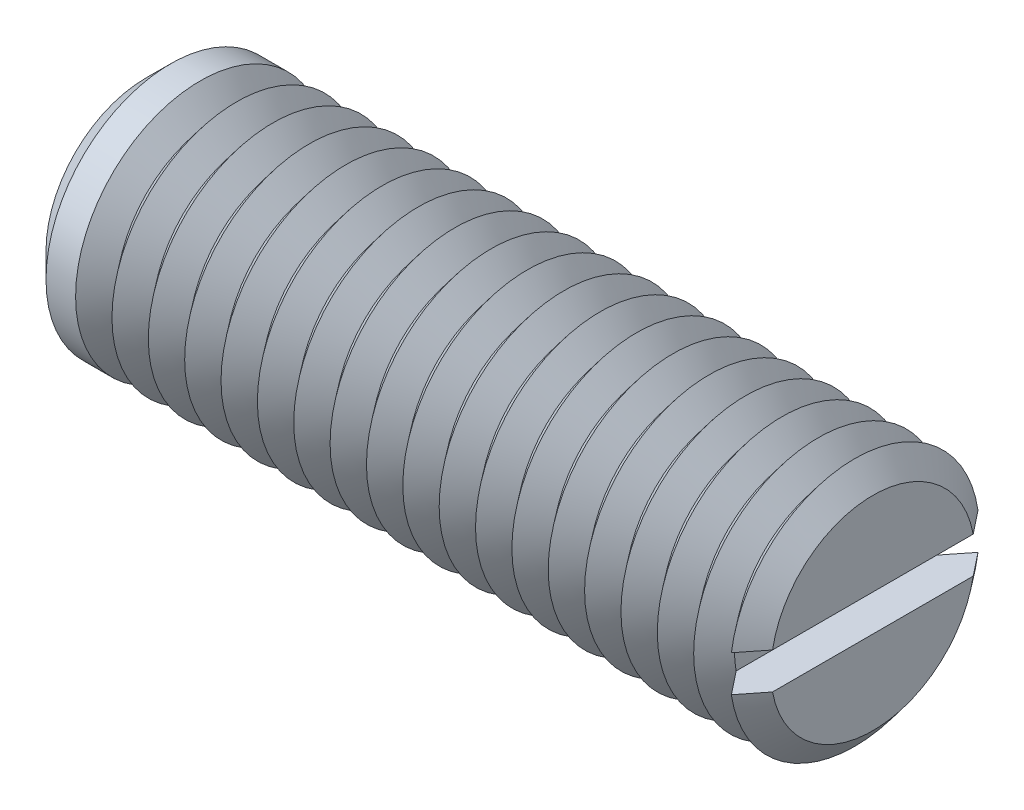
ISO-10303-21;
HEADER;
FILE_DESCRIPTION(('STEP AP214'),'2;1');
FILE_NAME('part.step','',(''),(''),'','','');
FILE_SCHEMA(('AUTOMOTIVE_DESIGN { 1 0 10303 214 1 1 1 1 }'));
ENDSEC;
DATA;
#1=APPLICATION_CONTEXT('core data for automotive mechanical design processes');
#2=APPLICATION_PROTOCOL_DEFINITION('international standard','automotive_design',2000,#1);
#3=PRODUCT_CONTEXT('',#1,'mechanical');
#4=PRODUCT('Part','Part','',(#3));
#5=PRODUCT_RELATED_PRODUCT_CATEGORY('part','',(#4));
#6=PRODUCT_DEFINITION_FORMATION('','',#4);
#7=PRODUCT_DEFINITION_CONTEXT('part definition',#1,'design');
#8=PRODUCT_DEFINITION('design','',#6,#7);
#9=PRODUCT_DEFINITION_SHAPE('','',#8);
#10=(LENGTH_UNIT() NAMED_UNIT(*) SI_UNIT(.MILLI.,.METRE.));
#11=(NAMED_UNIT(*) PLANE_ANGLE_UNIT() SI_UNIT($,.RADIAN.));
#12=(NAMED_UNIT(*) SI_UNIT($,.STERADIAN.) SOLID_ANGLE_UNIT());
#13=UNCERTAINTY_MEASURE_WITH_UNIT(LENGTH_MEASURE(1.E-05),#10,'distance_accuracy_value','');
#14=(GEOMETRIC_REPRESENTATION_CONTEXT(3) GLOBAL_UNCERTAINTY_ASSIGNED_CONTEXT((#13)) GLOBAL_UNIT_ASSIGNED_CONTEXT((#10,
#11,#12)) REPRESENTATION_CONTEXT('',''));
#15=CARTESIAN_POINT('',(0.,0.,0.));
#16=DIRECTION('',(0.,0.,1.));
#17=DIRECTION('',(1.,0.,0.));
#18=AXIS2_PLACEMENT_3D('',#15,#16,#17);
#19=CARTESIAN_POINT('',(16.625,0.,0.));
#20=DIRECTION('',(1.,0.,0.));
#21=DIRECTION('',(0.,0.,-1.));
#22=AXIS2_PLACEMENT_3D('',#19,#20,#21);
#23=CONICAL_SURFACE('',#22,6.,0.895664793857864);
#24=CARTESIAN_POINT('',(16.625,0.,0.));
#25=DIRECTION('',(-1.,0.,0.));
#26=DIRECTION('',(0.,0.,1.));
#27=AXIS2_PLACEMENT_3D('',#24,#25,#26);
#28=CIRCLE('',#27,6.);
#29=CARTESIAN_POINT('',(16.625,-0.875,-5.93585503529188));
#30=VERTEX_POINT('',#29);
#31=CARTESIAN_POINT('',(16.625,-0.875,5.93585503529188));
#32=VERTEX_POINT('',#31);
#33=EDGE_CURVE('E117',#30,#32,#28,.T.);
#34=ORIENTED_EDGE('',*,*,#33,.T.);
#35=CARTESIAN_POINT('',(22.315666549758,-0.875,-13.0784023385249));
#36=CARTESIAN_POINT('',(21.9425848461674,-0.875,-12.6113718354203));
#37=CARTESIAN_POINT('',(21.5695485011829,-0.875,-12.1443050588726));
#38=CARTESIAN_POINT('',(20.8235952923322,-0.875,-11.2100035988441));
#39=CARTESIAN_POINT('',(20.4506784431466,-0.875,-10.7427689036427));
#40=CARTESIAN_POINT('',(19.7043910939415,-0.875,-9.80728158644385));
#41=CARTESIAN_POINT('',(19.331020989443,-0.875,-9.33902864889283));
#42=CARTESIAN_POINT('',(18.584654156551,-0.875,-8.40229688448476));
#43=CARTESIAN_POINT('',(18.2116573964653,-0.875,-7.93381808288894));
#44=CARTESIAN_POINT('',(17.6431910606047,-0.875,-7.21894008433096));
#45=CARTESIAN_POINT('',(17.4475150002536,-0.875,-6.97270509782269));
#46=CARTESIAN_POINT('',(17.0563780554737,-0.875,-6.48006014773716));
#47=CARTESIAN_POINT('',(16.8609171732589,-0.875,-6.23365018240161));
#48=CARTESIAN_POINT('',(16.4702437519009,-0.875,-5.74051596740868));
#49=CARTESIAN_POINT('',(16.2750313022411,-0.875,-5.4937916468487));
#50=CARTESIAN_POINT('',(15.8850627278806,-0.875,-4.99999724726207));
#51=CARTESIAN_POINT('',(15.6903065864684,-0.875,-4.75292718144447));
#52=CARTESIAN_POINT('',(15.3017454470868,-0.875,-4.25854698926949));
#53=CARTESIAN_POINT('',(15.1079395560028,-0.875,-4.01123756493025));
#54=CARTESIAN_POINT('',(14.7214614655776,-0.875,-3.5156763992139));
#55=CARTESIAN_POINT('',(14.5287894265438,-0.875,-3.26742453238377));
#56=CARTESIAN_POINT('',(14.2415141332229,-0.875,-2.89382702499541));
#57=CARTESIAN_POINT('',(14.1460716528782,-0.875,-2.76912721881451));
#58=CARTESIAN_POINT('',(13.9560120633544,-0.875,-2.51908954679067));
#59=CARTESIAN_POINT('',(13.8613949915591,-0.875,-2.39375165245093));
#60=CARTESIAN_POINT('',(13.6734585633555,-0.875,-2.14215479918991));
#61=CARTESIAN_POINT('',(13.5801388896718,-0.875,-2.01589607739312));
#62=CARTESIAN_POINT('',(13.3955738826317,-0.875,-1.7618740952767));
#63=CARTESIAN_POINT('',(13.3043283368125,-0.875,-1.63411099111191));
#64=CARTESIAN_POINT('',(13.1947335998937,-0.875,-1.47575777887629));
#65=CARTESIAN_POINT('',(13.1745750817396,-0.875,-1.44642115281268));
#66=CARTESIAN_POINT('',(13.1344943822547,-0.875,-1.38758643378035));
#67=CARTESIAN_POINT('',(13.1145722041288,-0.875,-1.35808833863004));
#68=CARTESIAN_POINT('',(13.0552118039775,-0.875,-1.26931303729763));
#69=CARTESIAN_POINT('',(13.0161833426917,-0.875,-1.20976002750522));
#70=CARTESIAN_POINT('',(12.939598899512,-0.875,-1.08955604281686));
#71=CARTESIAN_POINT('',(12.9020457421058,-0.875,-1.02890325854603));
#72=CARTESIAN_POINT('',(12.8292052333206,-0.875,-0.906252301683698));
#73=CARTESIAN_POINT('',(12.7939174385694,-0.875,-0.844254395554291));
#74=CARTESIAN_POINT('',(12.7387563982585,-0.875,-0.740802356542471));
#75=CARTESIAN_POINT('',(12.717869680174,-0.875,-0.699896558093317));
#76=CARTESIAN_POINT('',(12.6780353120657,-0.875,-0.617162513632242));
#77=CARTESIAN_POINT('',(12.6590880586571,-0.875,-0.575334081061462));
#78=CARTESIAN_POINT('',(12.606232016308,-0.875,-0.448426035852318));
#79=CARTESIAN_POINT('',(12.5761075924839,-0.875,-0.361569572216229));
#80=CARTESIAN_POINT('',(12.5472166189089,-0.875,-0.240214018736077));
#81=CARTESIAN_POINT('',(12.5406925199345,-0.875,-0.207555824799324));
#82=CARTESIAN_POINT('',(12.5303887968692,-0.875,-0.14181650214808));
#83=CARTESIAN_POINT('',(12.5266076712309,-0.875,-0.108735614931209));
#84=CARTESIAN_POINT('',(12.5220436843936,-0.875,-0.0424543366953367));
#85=CARTESIAN_POINT('',(12.5212526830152,-0.875,-0.00925451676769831));
#86=CARTESIAN_POINT('',(12.5227025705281,-0.875,0.0570804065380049));
#87=CARTESIAN_POINT('',(12.5249438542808,-0.875,0.0902155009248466));
#88=CARTESIAN_POINT('',(12.5331880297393,-0.875,0.164063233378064));
#89=CARTESIAN_POINT('',(12.5399634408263,-0.875,0.20468951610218));
#90=CARTESIAN_POINT('',(12.5573167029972,-0.875,0.285126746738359));
#91=CARTESIAN_POINT('',(12.5678973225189,-0.875,0.324937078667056));
#92=CARTESIAN_POINT('',(12.5921930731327,-0.875,0.40389890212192));
#93=CARTESIAN_POINT('',(12.6059311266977,-0.875,0.443043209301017));
#94=CARTESIAN_POINT('',(12.6357974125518,-0.875,0.520385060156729));
#95=CARTESIAN_POINT('',(12.651925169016,-0.875,0.55858279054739));
#96=CARTESIAN_POINT('',(12.7021457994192,-0.875,0.669991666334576));
#97=CARTESIAN_POINT('',(12.7387706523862,-0.875,0.742052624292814));
#98=CARTESIAN_POINT('',(12.816117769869,-0.875,0.883956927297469));
#99=CARTESIAN_POINT('',(12.8568440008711,-0.875,0.953798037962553));
#100=CARTESIAN_POINT('',(12.9409804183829,-0.875,1.09208391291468));
#101=CARTESIAN_POINT('',(12.9843973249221,-0.875,1.16052456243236));
#102=CARTESIAN_POINT('',(13.0729384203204,-0.875,1.29629435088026));
#103=CARTESIAN_POINT('',(13.118062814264,-0.875,1.36362335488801));
#104=CARTESIAN_POINT('',(13.2096565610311,-0.875,1.49772496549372));
#105=CARTESIAN_POINT('',(13.2561302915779,-0.875,1.56449457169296));
#106=CARTESIAN_POINT('',(13.3499281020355,-0.875,1.69744165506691));
#107=CARTESIAN_POINT('',(13.3972522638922,-0.875,1.76361907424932));
#108=CARTESIAN_POINT('',(13.4924358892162,-0.875,1.89539956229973));
#109=CARTESIAN_POINT('',(13.5402941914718,-0.875,1.96100347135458));
#110=CARTESIAN_POINT('',(13.6364816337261,-0.875,2.09186112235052));
#111=CARTESIAN_POINT('',(13.6848107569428,-0.875,2.15711487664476));
#112=CARTESIAN_POINT('',(13.8290907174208,-0.875,2.35079303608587));
#113=CARTESIAN_POINT('',(13.925565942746,-0.875,2.47882657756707));
#114=CARTESIAN_POINT('',(14.1194152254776,-0.875,2.73421191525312));
#115=CARTESIAN_POINT('',(14.216789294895,-0.875,2.86156370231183));
#116=CARTESIAN_POINT('',(14.5098183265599,-0.875,3.24294102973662));
#117=CARTESIAN_POINT('',(14.7063709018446,-0.875,3.49627631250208));
#118=CARTESIAN_POINT('',(15.1008478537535,-0.875,4.00219025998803));
#119=CARTESIAN_POINT('',(15.2987731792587,-0.875,4.25476818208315));
#120=CARTESIAN_POINT('',(15.6953507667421,-0.875,4.75934213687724));
#121=CARTESIAN_POINT('',(15.894003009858,-0.875,5.01133818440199));
#122=CARTESIAN_POINT('',(16.2908446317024,-0.875,5.51379367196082));
#123=CARTESIAN_POINT('',(16.4890318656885,-0.875,5.76425480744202));
#124=CARTESIAN_POINT('',(16.8857195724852,-0.875,6.26493161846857));
#125=CARTESIAN_POINT('',(17.0842200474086,-0.875,6.51514729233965));
#126=CARTESIAN_POINT('',(17.6799499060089,-0.875,7.26541710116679));
#127=CARTESIAN_POINT('',(18.0775028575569,-0.875,7.76521426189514));
#128=CARTESIAN_POINT('',(18.7943115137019,-0.875,8.6655030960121));
#129=CARTESIAN_POINT('',(19.1134832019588,-0.875,9.06606170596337));
#130=CARTESIAN_POINT('',(19.7520581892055,-0.875,9.86704239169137));
#131=CARTESIAN_POINT('',(20.0714615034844,-0.875,10.2674644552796));
#132=CARTESIAN_POINT('',(20.7116162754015,-0.875,11.0697025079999));
#133=CARTESIAN_POINT('',(21.0323682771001,-0.875,11.4715180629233));
#134=CARTESIAN_POINT('',(21.6739570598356,-0.875,12.2750327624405));
#135=CARTESIAN_POINT('',(21.9947938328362,-0.875,12.6767319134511));
#136=CARTESIAN_POINT('',(22.315666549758,-0.875,13.0784023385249));
#137=B_SPLINE_CURVE_WITH_KNOTS('',3,(#35,#36,#37,#38,#39,#40,#41,#42,#43,#44,#45,#46,#47,#48,
#49,#50,#51,#52,#53,#54,#55,#56,#57,#58,#59,#60,#61,#62,#63,#64,#65,#66,#67,#68,#69,#70,#71,#72,
#73,#74,#75,#76,#77,#78,#79,#80,#81,#82,#83,#84,#85,#86,#87,#88,#89,#90,#91,#92,#93,#94,#95,#96,
#97,#98,#99,#100,#101,#102,#103,#104,#105,#106,#107,#108,#109,#110,#111,#112,#113,#114,#115,
#116,#117,#118,#119,#120,#121,#122,#123,#124,#125,#126,#127,#128,#129,#130,#131,#132,#133,#134,
#135,#136),.UNSPECIFIED.,.F.,.F.,(4,2,2,2,2,2,2,2,2,2,2,2,2,2,2,2,2,2,2,2,2,2,2,2,2,2,2,2,2,2,2,
2,2,2,2,2,2,2,2,2,2,2,2,2,2,2,2,2,2,2,4),(0.,1.7932560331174,3.58668207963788,5.38334403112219,
7.17983772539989,8.12338791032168,9.0669477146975,10.0107838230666,10.9545848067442,
11.8971886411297,12.8399226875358,13.3110192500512,13.7821370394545,14.2531375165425,
14.72408952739,14.8308734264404,14.9376587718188,15.1512485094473,15.3652290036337,
15.5791674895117,15.7169026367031,15.8546658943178,16.1289739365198,16.2287885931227,
16.3285485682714,16.4280367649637,16.5275379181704,16.6508760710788,16.7743041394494,
16.8986582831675,17.0229876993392,17.2652294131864,17.5077076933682,17.7508180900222,
17.9939577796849,18.2380016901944,18.4820692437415,18.7256822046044,18.9692865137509,
19.4502162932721,19.9311525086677,20.8930708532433,21.855738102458,22.8183805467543,
23.7765455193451,24.7347169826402,26.6505999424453,28.1871088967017,29.7237307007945,
31.2661438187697,32.8084427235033),.UNSPECIFIED.);
#138=CARTESIAN_POINT('',(15.75,-0.875,4.82848363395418));
#139=VERTEX_POINT('',#138);
#140=EDGE_CURVE('E109',#139,#32,#137,.T.);
#141=ORIENTED_EDGE('',*,*,#140,.F.);
#142=CARTESIAN_POINT('',(15.75,0.,0.));
#143=DIRECTION('',(-1.,0.,0.));
#144=DIRECTION('',(0.,0.,1.));
#145=AXIS2_PLACEMENT_3D('',#142,#143,#144);
#146=CIRCLE('',#145,4.90712535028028);
#147=CARTESIAN_POINT('',(15.75,-0.875,-4.82848363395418));
#148=VERTEX_POINT('',#147);
#149=EDGE_CURVE('E369',#148,#139,#146,.T.);
#150=ORIENTED_EDGE('',*,*,#149,.F.);
#151=EDGE_CURVE('E58',#30,#148,#137,.T.);
#152=ORIENTED_EDGE('',*,*,#151,.F.);
#153=EDGE_LOOP('',(#34,#141,#150,#152));
#154=FACE_BOUND('',#153,.T.);
#155=ADVANCED_FACE('F37',(#154),#23,.T.);
#156=CARTESIAN_POINT('',(16.625,0.875,5.93585503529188));
#157=VERTEX_POINT('',#156);
#158=CARTESIAN_POINT('',(16.625,0.875,-5.93585503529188));
#159=VERTEX_POINT('',#158);
#160=EDGE_CURVE('E100',#157,#159,#28,.T.);
#161=ORIENTED_EDGE('',*,*,#160,.T.);
#162=CARTESIAN_POINT('',(22.315666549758,0.875,13.0784023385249));
#163=CARTESIAN_POINT('',(21.9425848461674,0.875,12.6113718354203));
#164=CARTESIAN_POINT('',(21.5695485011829,0.875,12.1443050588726));
#165=CARTESIAN_POINT('',(20.8235952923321,0.875,11.2100035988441));
#166=CARTESIAN_POINT('',(20.4506784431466,0.875,10.7427689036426));
#167=CARTESIAN_POINT('',(19.7043910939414,0.875,9.80728158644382));
#168=CARTESIAN_POINT('',(19.331020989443,0.875,9.33902864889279));
#169=CARTESIAN_POINT('',(18.584654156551,0.875,8.40229688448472));
#170=CARTESIAN_POINT('',(18.2116573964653,0.875,7.93381808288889));
#171=CARTESIAN_POINT('',(17.6431910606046,0.875,7.21894008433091));
#172=CARTESIAN_POINT('',(17.4475150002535,0.875,6.97270509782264));
#173=CARTESIAN_POINT('',(17.0563780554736,0.875,6.48006014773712));
#174=CARTESIAN_POINT('',(16.8609171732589,0.875,6.23365018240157));
#175=CARTESIAN_POINT('',(16.4702437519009,0.875,5.74051596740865));
#176=CARTESIAN_POINT('',(16.275031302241,0.875,5.49379164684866));
#177=CARTESIAN_POINT('',(15.8850627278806,0.875,4.99999724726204));
#178=CARTESIAN_POINT('',(15.6903065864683,0.875,4.75292718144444));
#179=CARTESIAN_POINT('',(15.3017454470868,0.875,4.25854698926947));
#180=CARTESIAN_POINT('',(15.1079395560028,0.875,4.01123756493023));
#181=CARTESIAN_POINT('',(14.7214614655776,0.875,3.51567639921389));
#182=CARTESIAN_POINT('',(14.5287894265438,0.875,3.26742453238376));
#183=CARTESIAN_POINT('',(14.2415141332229,0.875,2.8938270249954));
#184=CARTESIAN_POINT('',(14.1460716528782,0.875,2.7691272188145));
#185=CARTESIAN_POINT('',(13.9560120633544,0.875,2.51908954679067));
#186=CARTESIAN_POINT('',(13.8613949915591,0.875,2.39375165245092));
#187=CARTESIAN_POINT('',(13.6734585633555,0.875,2.14215479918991));
#188=CARTESIAN_POINT('',(13.5801388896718,0.875,2.01589607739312));
#189=CARTESIAN_POINT('',(13.3955738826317,0.875,1.7618740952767));
#190=CARTESIAN_POINT('',(13.3043283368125,0.875,1.63411099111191));
#191=CARTESIAN_POINT('',(13.1947335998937,0.875,1.47575777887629));
#192=CARTESIAN_POINT('',(13.1745750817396,0.875,1.44642115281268));
#193=CARTESIAN_POINT('',(13.1344943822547,0.875,1.38758643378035));
#194=CARTESIAN_POINT('',(13.1145722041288,0.875,1.35808833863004));
#195=CARTESIAN_POINT('',(13.0552118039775,0.875,1.26931303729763));
#196=CARTESIAN_POINT('',(13.0161833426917,0.875,1.20976002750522));
#197=CARTESIAN_POINT('',(12.939598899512,0.875,1.08955604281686));
#198=CARTESIAN_POINT('',(12.9020457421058,0.875,1.02890325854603));
#199=CARTESIAN_POINT('',(12.8292052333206,0.875,0.906252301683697));
#200=CARTESIAN_POINT('',(12.7939174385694,0.875,0.844254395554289));
#201=CARTESIAN_POINT('',(12.7387563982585,0.875,0.740802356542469));
#202=CARTESIAN_POINT('',(12.717869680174,0.875,0.699896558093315));
#203=CARTESIAN_POINT('',(12.6780353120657,0.875,0.617162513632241));
#204=CARTESIAN_POINT('',(12.6590880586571,0.875,0.575334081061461));
#205=CARTESIAN_POINT('',(12.606232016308,0.875,0.448426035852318));
#206=CARTESIAN_POINT('',(12.5761075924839,0.875,0.361569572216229));
#207=CARTESIAN_POINT('',(12.5472166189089,0.875,0.240214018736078));
#208=CARTESIAN_POINT('',(12.5406925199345,0.875,0.207555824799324));
#209=CARTESIAN_POINT('',(12.5303887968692,0.875,0.141816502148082));
#210=CARTESIAN_POINT('',(12.5266076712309,0.875,0.108735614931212));
#211=CARTESIAN_POINT('',(12.5220436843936,0.875,0.0424543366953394));
#212=CARTESIAN_POINT('',(12.5212526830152,0.875,0.00925451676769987));
#213=CARTESIAN_POINT('',(12.5227025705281,0.875,-0.0570804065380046));
#214=CARTESIAN_POINT('',(12.5249438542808,0.875,-0.0902155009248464));
#215=CARTESIAN_POINT('',(12.5331880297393,0.875,-0.164063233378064));
#216=CARTESIAN_POINT('',(12.5399634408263,0.875,-0.204689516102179));
#217=CARTESIAN_POINT('',(12.5573167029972,0.875,-0.28512674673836));
#218=CARTESIAN_POINT('',(12.5678973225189,0.875,-0.324937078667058));
#219=CARTESIAN_POINT('',(12.5921930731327,0.875,-0.403898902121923));
#220=CARTESIAN_POINT('',(12.6059311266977,0.875,-0.443043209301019));
#221=CARTESIAN_POINT('',(12.6357974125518,0.875,-0.520385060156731));
#222=CARTESIAN_POINT('',(12.651925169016,0.875,-0.558582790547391));
#223=CARTESIAN_POINT('',(12.7021457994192,0.875,-0.669991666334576));
#224=CARTESIAN_POINT('',(12.7387706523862,0.875,-0.742052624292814));
#225=CARTESIAN_POINT('',(12.816117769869,0.875,-0.883956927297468));
#226=CARTESIAN_POINT('',(12.8568440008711,0.875,-0.95379803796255));
#227=CARTESIAN_POINT('',(12.9409804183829,0.875,-1.09208391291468));
#228=CARTESIAN_POINT('',(12.9843973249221,0.875,-1.16052456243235));
#229=CARTESIAN_POINT('',(13.0729384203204,0.875,-1.29629435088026));
#230=CARTESIAN_POINT('',(13.118062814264,0.875,-1.36362335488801));
#231=CARTESIAN_POINT('',(13.2096565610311,0.875,-1.49772496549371));
#232=CARTESIAN_POINT('',(13.2561302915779,0.875,-1.56449457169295));
#233=CARTESIAN_POINT('',(13.3499281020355,0.875,-1.69744165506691));
#234=CARTESIAN_POINT('',(13.3972522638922,0.875,-1.76361907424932));
#235=CARTESIAN_POINT('',(13.4924358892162,0.875,-1.89539956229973));
#236=CARTESIAN_POINT('',(13.5402941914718,0.875,-1.96100347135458));
#237=CARTESIAN_POINT('',(13.6364816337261,0.875,-2.09186112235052));
#238=CARTESIAN_POINT('',(13.6848107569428,0.875,-2.15711487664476));
#239=CARTESIAN_POINT('',(13.8290907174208,0.875,-2.35079303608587));
#240=CARTESIAN_POINT('',(13.925565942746,0.875,-2.47882657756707));
#241=CARTESIAN_POINT('',(14.1194152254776,0.875,-2.73421191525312));
#242=CARTESIAN_POINT('',(14.216789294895,0.875,-2.86156370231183));
#243=CARTESIAN_POINT('',(14.5098183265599,0.875,-3.24294102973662));
#244=CARTESIAN_POINT('',(14.7063709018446,0.875,-3.49627631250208));
#245=CARTESIAN_POINT('',(15.1008478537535,0.875,-4.00219025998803));
#246=CARTESIAN_POINT('',(15.2987731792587,0.875,-4.25476818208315));
#247=CARTESIAN_POINT('',(15.6953507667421,0.875,-4.75934213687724));
#248=CARTESIAN_POINT('',(15.894003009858,0.875,-5.01133818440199));
#249=CARTESIAN_POINT('',(16.2908446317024,0.875,-5.51379367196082));
#250=CARTESIAN_POINT('',(16.4890318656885,0.875,-5.76425480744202));
#251=CARTESIAN_POINT('',(16.8857195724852,0.875,-6.26493161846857));
#252=CARTESIAN_POINT('',(17.0842200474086,0.875,-6.51514729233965));
#253=CARTESIAN_POINT('',(17.6799499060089,0.875,-7.26541710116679));
#254=CARTESIAN_POINT('',(18.0775028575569,0.875,-7.76521426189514));
#255=CARTESIAN_POINT('',(18.7943115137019,0.875,-8.6655030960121));
#256=CARTESIAN_POINT('',(19.1134832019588,0.875,-9.06606170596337));
#257=CARTESIAN_POINT('',(19.7520581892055,0.875,-9.86704239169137));
#258=CARTESIAN_POINT('',(20.0714615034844,0.875,-10.2674644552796));
#259=CARTESIAN_POINT('',(20.7116162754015,0.875,-11.0697025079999));
#260=CARTESIAN_POINT('',(21.0323682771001,0.875,-11.4715180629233));
#261=CARTESIAN_POINT('',(21.6739570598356,0.875,-12.2750327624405));
#262=CARTESIAN_POINT('',(21.9947938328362,0.875,-12.6767319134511));
#263=CARTESIAN_POINT('',(22.315666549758,0.875,-13.0784023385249));
#264=B_SPLINE_CURVE_WITH_KNOTS('',3,(#162,#163,#164,#165,#166,#167,#168,#169,#170,#171,#172,
#173,#174,#175,#176,#177,#178,#179,#180,#181,#182,#183,#184,#185,#186,#187,#188,#189,#190,#191,
#192,#193,#194,#195,#196,#197,#198,#199,#200,#201,#202,#203,#204,#205,#206,#207,#208,#209,#210,
#211,#212,#213,#214,#215,#216,#217,#218,#219,#220,#221,#222,#223,#224,#225,#226,#227,#228,#229,
#230,#231,#232,#233,#234,#235,#236,#237,#238,#239,#240,#241,#242,#243,#244,#245,#246,#247,#248,
#249,#250,#251,#252,#253,#254,#255,#256,#257,#258,#259,#260,#261,#262,#263),.UNSPECIFIED.,.F.,
.F.,(4,2,2,2,2,2,2,2,2,2,2,2,2,2,2,2,2,2,2,2,2,2,2,2,2,2,2,2,2,2,2,2,2,2,2,2,2,2,2,2,2,2,2,2,2,
2,2,2,2,2,4),(0.,1.79325603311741,3.58668207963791,5.38334403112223,7.17983772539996,
8.12338791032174,9.06694771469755,10.0107838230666,10.9545848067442,11.8971886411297,
12.8399226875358,13.3110192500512,13.7821370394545,14.2531375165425,14.72408952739,
14.8308734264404,14.9376587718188,15.1512485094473,15.3652290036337,15.5791674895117,
15.7169026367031,15.8546658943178,16.1289739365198,16.2287885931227,16.3285485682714,
16.4280367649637,16.5275379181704,16.6508760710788,16.7743041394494,16.8986582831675,
17.0229876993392,17.2652294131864,17.5077076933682,17.7508180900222,17.9939577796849,
18.2380016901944,18.4820692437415,18.7256822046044,18.9692865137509,19.4502162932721,
19.9311525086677,20.8930708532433,21.855738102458,22.8183805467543,23.7765455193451,
24.7347169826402,26.6505999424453,28.1871088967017,29.7237307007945,31.2661438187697,
32.8084427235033),.UNSPECIFIED.);
#265=CARTESIAN_POINT('',(15.75,0.875,-4.82848363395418));
#266=VERTEX_POINT('',#265);
#267=EDGE_CURVE('E110',#266,#159,#264,.T.);
#268=ORIENTED_EDGE('',*,*,#267,.F.);
#269=CARTESIAN_POINT('',(15.75,0.875,4.82848363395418));
#270=VERTEX_POINT('',#269);
#271=EDGE_CURVE('E103',#270,#266,#146,.T.);
#272=ORIENTED_EDGE('',*,*,#271,.F.);
#273=EDGE_CURVE('E97',#157,#270,#264,.T.);
#274=ORIENTED_EDGE('',*,*,#273,.F.);
#275=EDGE_LOOP('',(#161,#268,#272,#274));
#276=FACE_BOUND('',#275,.T.);
#277=ADVANCED_FACE('F99',(#276),#23,.T.);
#278=CARTESIAN_POINT('',(15.75,0.,0.));
#279=DIRECTION('',(-1.,0.,0.));
#280=DIRECTION('',(0.,0.,1.));
#281=AXIS2_PLACEMENT_3D('',#278,#279,#280);
#282=CONICAL_SURFACE('',#281,4.90712535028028,0.895664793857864);
#283=CARTESIAN_POINT('',(14.875,0.,0.));
#284=DIRECTION('',(-1.,0.,0.));
#285=DIRECTION('',(0.,0.,1.));
#286=AXIS2_PLACEMENT_3D('',#283,#284,#285);
#287=CIRCLE('',#286,6.);
#288=CARTESIAN_POINT('',(14.875,0.,6.));
#289=VERTEX_POINT('',#288);
#290=EDGE_CURVE('E355',#289,#289,#287,.T.);
#291=ORIENTED_EDGE('',*,*,#290,.F.);
#292=EDGE_LOOP('',(#291));
#293=FACE_BOUND('',#292,.T.);
#294=ORIENTED_EDGE('',*,*,#271,.T.);
#295=EDGE_CURVE('E363',#266,#148,#146,.T.);
#296=ORIENTED_EDGE('',*,*,#295,.T.);
#297=ORIENTED_EDGE('',*,*,#149,.T.);
#298=EDGE_CURVE('E361',#139,#270,#146,.T.);
#299=ORIENTED_EDGE('',*,*,#298,.T.);
#300=EDGE_LOOP('',(#294,#296,#297,#299));
#301=FACE_BOUND('',#300,.T.);
#302=ADVANCED_FACE('F167',(#293,#301),#282,.T.);
#303=CARTESIAN_POINT('',(17.5,0.,0.));
#304=DIRECTION('',(1.,0.,0.));
#305=DIRECTION('',(0.,0.,-1.));
#306=AXIS2_PLACEMENT_3D('',#303,#304,#305);
#307=PLANE('',#306);
#308=CARTESIAN_POINT('',(17.5,0.,0.));
#309=DIRECTION('',(-1.,0.,0.));
#310=DIRECTION('',(0.,0.,1.));
#311=AXIS2_PLACEMENT_3D('',#308,#309,#310);
#312=CIRCLE('',#311,4.90712535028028);
#313=CARTESIAN_POINT('',(17.5,0.875,4.82848363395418));
#314=VERTEX_POINT('',#313);
#315=CARTESIAN_POINT('',(17.5,0.875,-4.82848363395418));
#316=VERTEX_POINT('',#315);
#317=EDGE_CURVE('E159',#314,#316,#312,.T.);
#318=ORIENTED_EDGE('',*,*,#317,.F.);
#319=DIRECTION('',(0.,0.,1.));
#320=VECTOR('',#319,1.);
#321=CARTESIAN_POINT('',(17.5,0.875,0.));
#322=LINE('',#321,#320);
#323=EDGE_CURVE('E122',#316,#314,#322,.T.);
#324=ORIENTED_EDGE('',*,*,#323,.F.);
#325=EDGE_LOOP('',(#318,#324));
#326=FACE_BOUND('',#325,.T.);
#327=ADVANCED_FACE('F171',(#326),#307,.T.);
#328=CARTESIAN_POINT('',(17.5,-0.875,-4.82848363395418));
#329=VERTEX_POINT('',#328);
#330=CARTESIAN_POINT('',(17.5,-0.875,4.82848363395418));
#331=VERTEX_POINT('',#330);
#332=EDGE_CURVE('E66',#329,#331,#312,.T.);
#333=ORIENTED_EDGE('',*,*,#332,.F.);
#334=DIRECTION('',(0.,0.,-1.));
#335=VECTOR('',#334,1.);
#336=CARTESIAN_POINT('',(17.5,-0.875,0.));
#337=LINE('',#336,#335);
#338=EDGE_CURVE('E136',#331,#329,#337,.T.);
#339=ORIENTED_EDGE('',*,*,#338,.F.);
#340=EDGE_LOOP('',(#333,#339));
#341=FACE_BOUND('',#340,.T.);
#342=ADVANCED_FACE('F200',(#341),#307,.T.);
#343=CARTESIAN_POINT('',(17.5,0.,0.));
#344=DIRECTION('',(-1.,0.,0.));
#345=DIRECTION('',(0.,0.,1.));
#346=AXIS2_PLACEMENT_3D('',#343,#344,#345);
#347=CONICAL_SURFACE('',#346,4.90712535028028,0.895664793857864);
#348=ORIENTED_EDGE('',*,*,#160,.F.);
#349=CARTESIAN_POINT('',(10.934333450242,0.875,-13.0784023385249));
#350=CARTESIAN_POINT('',(11.3074151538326,0.875,-12.6113718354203));
#351=CARTESIAN_POINT('',(11.6804514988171,0.875,-12.1443050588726));
#352=CARTESIAN_POINT('',(12.4264047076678,0.875,-11.2100035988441));
#353=CARTESIAN_POINT('',(12.7993215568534,0.875,-10.7427689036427));
#354=CARTESIAN_POINT('',(13.5456089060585,0.875,-9.80728158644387));
#355=CARTESIAN_POINT('',(13.9189790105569,0.875,-9.33902864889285));
#356=CARTESIAN_POINT('',(14.665345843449,0.875,-8.40229688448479));
#357=CARTESIAN_POINT('',(15.0383426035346,0.875,-7.93381808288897));
#358=CARTESIAN_POINT('',(15.6068089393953,0.875,-7.21894008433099));
#359=CARTESIAN_POINT('',(15.8024849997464,0.875,-6.97270509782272));
#360=CARTESIAN_POINT('',(16.1936219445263,0.875,-6.48006014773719));
#361=CARTESIAN_POINT('',(16.389082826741,0.875,-6.23365018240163));
#362=CARTESIAN_POINT('',(16.7797562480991,0.875,-5.7405159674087));
#363=CARTESIAN_POINT('',(16.9749686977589,0.875,-5.49379164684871));
#364=CARTESIAN_POINT('',(17.3649372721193,0.875,-4.99999724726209));
#365=CARTESIAN_POINT('',(17.5596934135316,0.875,-4.75292718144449));
#366=CARTESIAN_POINT('',(17.9482545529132,0.875,-4.25854698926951));
#367=CARTESIAN_POINT('',(18.1420604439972,0.875,-4.01123756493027));
#368=CARTESIAN_POINT('',(18.5285385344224,0.875,-3.51567639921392));
#369=CARTESIAN_POINT('',(18.7212105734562,0.875,-3.26742453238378));
#370=CARTESIAN_POINT('',(19.0084858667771,0.875,-2.89382702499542));
#371=CARTESIAN_POINT('',(19.1039283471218,0.875,-2.76912721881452));
#372=CARTESIAN_POINT('',(19.2939879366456,0.875,-2.51908954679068));
#373=CARTESIAN_POINT('',(19.3886050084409,0.875,-2.39375165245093));
#374=CARTESIAN_POINT('',(19.5765414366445,0.875,-2.14215479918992));
#375=CARTESIAN_POINT('',(19.6698611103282,0.875,-2.01589607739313));
#376=CARTESIAN_POINT('',(19.8544261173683,0.875,-1.76187409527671));
#377=CARTESIAN_POINT('',(19.9456716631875,0.875,-1.63411099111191));
#378=CARTESIAN_POINT('',(20.0552664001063,0.875,-1.47575777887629));
#379=CARTESIAN_POINT('',(20.0754249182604,0.875,-1.44642115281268));
#380=CARTESIAN_POINT('',(20.1155056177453,0.875,-1.38758643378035));
#381=CARTESIAN_POINT('',(20.1354277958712,0.875,-1.35808833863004));
#382=CARTESIAN_POINT('',(20.1947881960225,0.875,-1.26931303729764));
#383=CARTESIAN_POINT('',(20.2338166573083,0.875,-1.20976002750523));
#384=CARTESIAN_POINT('',(20.310401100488,0.875,-1.08955604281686));
#385=CARTESIAN_POINT('',(20.3479542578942,0.875,-1.02890325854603));
#386=CARTESIAN_POINT('',(20.4207947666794,0.875,-0.9062523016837));
#387=CARTESIAN_POINT('',(20.4560825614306,0.875,-0.844254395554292));
#388=CARTESIAN_POINT('',(20.5112436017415,0.875,-0.740802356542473));
#389=CARTESIAN_POINT('',(20.532130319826,0.875,-0.699896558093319));
#390=CARTESIAN_POINT('',(20.5719646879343,0.875,-0.617162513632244));
#391=CARTESIAN_POINT('',(20.5909119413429,0.875,-0.575334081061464));
#392=CARTESIAN_POINT('',(20.643767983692,0.875,-0.448426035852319));
#393=CARTESIAN_POINT('',(20.6738924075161,0.875,-0.361569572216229));
#394=CARTESIAN_POINT('',(20.7027833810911,0.875,-0.240214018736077));
#395=CARTESIAN_POINT('',(20.7093074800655,0.875,-0.207555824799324));
#396=CARTESIAN_POINT('',(20.7196112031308,0.875,-0.141816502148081));
#397=CARTESIAN_POINT('',(20.7233923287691,0.875,-0.108735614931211));
#398=CARTESIAN_POINT('',(20.7279563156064,0.875,-0.0424543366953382));
#399=CARTESIAN_POINT('',(20.7287473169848,0.875,-0.00925451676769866));
#400=CARTESIAN_POINT('',(20.727297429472,0.875,0.0570804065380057));
#401=CARTESIAN_POINT('',(20.7250561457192,0.875,0.0902155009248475));
#402=CARTESIAN_POINT('',(20.7168119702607,0.875,0.164063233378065));
#403=CARTESIAN_POINT('',(20.7100365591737,0.875,0.20468951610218));
#404=CARTESIAN_POINT('',(20.6926832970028,0.875,0.28512674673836));
#405=CARTESIAN_POINT('',(20.6821026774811,0.875,0.324937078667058));
#406=CARTESIAN_POINT('',(20.6578069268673,0.875,0.403898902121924));
#407=CARTESIAN_POINT('',(20.6440688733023,0.875,0.443043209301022));
#408=CARTESIAN_POINT('',(20.6142025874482,0.875,0.520385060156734));
#409=CARTESIAN_POINT('',(20.598074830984,0.875,0.558582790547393));
#410=CARTESIAN_POINT('',(20.5478542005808,0.875,0.669991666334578));
#411=CARTESIAN_POINT('',(20.5112293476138,0.875,0.742052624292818));
#412=CARTESIAN_POINT('',(20.433882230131,0.875,0.883956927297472));
#413=CARTESIAN_POINT('',(20.3931559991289,0.875,0.953798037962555));
#414=CARTESIAN_POINT('',(20.3090195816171,0.875,1.09208391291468));
#415=CARTESIAN_POINT('',(20.2656026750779,0.875,1.16052456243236));
#416=CARTESIAN_POINT('',(20.1770615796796,0.875,1.29629435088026));
#417=CARTESIAN_POINT('',(20.131937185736,0.875,1.36362335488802));
#418=CARTESIAN_POINT('',(20.0403434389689,0.875,1.49772496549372));
#419=CARTESIAN_POINT('',(19.9938697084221,0.875,1.56449457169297));
#420=CARTESIAN_POINT('',(19.9000718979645,0.875,1.69744165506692));
#421=CARTESIAN_POINT('',(19.8527477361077,0.875,1.76361907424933));
#422=CARTESIAN_POINT('',(19.7575641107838,0.875,1.89539956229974));
#423=CARTESIAN_POINT('',(19.7097058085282,0.875,1.96100347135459));
#424=CARTESIAN_POINT('',(19.6135183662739,0.875,2.09186112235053));
#425=CARTESIAN_POINT('',(19.5651892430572,0.875,2.15711487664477));
#426=CARTESIAN_POINT('',(19.4209092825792,0.875,2.35079303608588));
#427=CARTESIAN_POINT('',(19.3244340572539,0.875,2.47882657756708));
#428=CARTESIAN_POINT('',(19.1305847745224,0.875,2.73421191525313));
#429=CARTESIAN_POINT('',(19.033210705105,0.875,2.86156370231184));
#430=CARTESIAN_POINT('',(18.74018167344,0.875,3.24294102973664));
#431=CARTESIAN_POINT('',(18.5436290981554,0.875,3.49627631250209));
#432=CARTESIAN_POINT('',(18.1491521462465,0.875,4.00219025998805));
#433=CARTESIAN_POINT('',(17.9512268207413,0.875,4.25476818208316));
#434=CARTESIAN_POINT('',(17.5546492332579,0.875,4.75934213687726));
#435=CARTESIAN_POINT('',(17.355996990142,0.875,5.01133818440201));
#436=CARTESIAN_POINT('',(16.9591553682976,0.875,5.51379367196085));
#437=CARTESIAN_POINT('',(16.7609681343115,0.875,5.76425480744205));
#438=CARTESIAN_POINT('',(16.3642804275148,0.875,6.2649316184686));
#439=CARTESIAN_POINT('',(16.1657799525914,0.875,6.51514729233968));
#440=CARTESIAN_POINT('',(15.5700500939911,0.875,7.26541710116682));
#441=CARTESIAN_POINT('',(15.1724971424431,0.875,7.76521426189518));
#442=CARTESIAN_POINT('',(14.455688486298,0.875,8.66550309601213));
#443=CARTESIAN_POINT('',(14.1365167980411,0.875,9.0660617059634));
#444=CARTESIAN_POINT('',(13.4979418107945,0.875,9.8670423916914));
#445=CARTESIAN_POINT('',(13.1785384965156,0.875,10.2674644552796));
#446=CARTESIAN_POINT('',(12.5383837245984,0.875,11.0697025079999));
#447=CARTESIAN_POINT('',(12.2176317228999,0.875,11.4715180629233));
#448=CARTESIAN_POINT('',(11.5760429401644,0.875,12.2750327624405));
#449=CARTESIAN_POINT('',(11.2552061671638,0.875,12.6767319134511));
#450=CARTESIAN_POINT('',(10.934333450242,0.875,13.0784023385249));
#451=B_SPLINE_CURVE_WITH_KNOTS('',3,(#349,#350,#351,#352,#353,#354,#355,#356,#357,#358,#359,
#360,#361,#362,#363,#364,#365,#366,#367,#368,#369,#370,#371,#372,#373,#374,#375,#376,#377,#378,
#379,#380,#381,#382,#383,#384,#385,#386,#387,#388,#389,#390,#391,#392,#393,#394,#395,#396,#397,
#398,#399,#400,#401,#402,#403,#404,#405,#406,#407,#408,#409,#410,#411,#412,#413,#414,#415,#416,
#417,#418,#419,#420,#421,#422,#423,#424,#425,#426,#427,#428,#429,#430,#431,#432,#433,#434,#435,
#436,#437,#438,#439,#440,#441,#442,#443,#444,#445,#446,#447,#448,#449,#450),.UNSPECIFIED.,.F.,
.F.,(4,2,2,2,2,2,2,2,2,2,2,2,2,2,2,2,2,2,2,2,2,2,2,2,2,2,2,2,2,2,2,2,2,2,2,2,2,2,2,2,2,2,2,2,2,
2,2,2,2,2,4),(0.,1.79325603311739,3.58668207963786,5.38334403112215,7.17983772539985,
8.12338791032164,9.06694771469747,10.0107838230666,10.9545848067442,11.8971886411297,
12.8399226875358,13.3110192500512,13.7821370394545,14.2531375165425,14.72408952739,
14.8308734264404,14.9376587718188,15.1512485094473,15.3652290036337,15.5791674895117,
15.7169026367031,15.8546658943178,16.1289739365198,16.2287885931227,16.3285485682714,
16.4280367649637,16.5275379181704,16.6508760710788,16.7743041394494,16.8986582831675,
17.0229876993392,17.2652294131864,17.5077076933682,17.7508180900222,17.9939577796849,
18.2380016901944,18.4820692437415,18.7256822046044,18.9692865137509,19.4502162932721,
19.9311525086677,20.8930708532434,21.855738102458,22.8183805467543,23.7765455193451,
24.7347169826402,26.6505999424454,28.1871088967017,29.7237307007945,31.2661438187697,
32.8084427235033),.UNSPECIFIED.);
#452=EDGE_CURVE('E41',#314,#157,#451,.T.);
#453=ORIENTED_EDGE('',*,*,#452,.F.);
#454=ORIENTED_EDGE('',*,*,#317,.T.);
#455=EDGE_CURVE('E11',#159,#316,#451,.T.);
#456=ORIENTED_EDGE('',*,*,#455,.F.);
#457=EDGE_LOOP('',(#348,#453,#454,#456));
#458=FACE_BOUND('',#457,.T.);
#459=ADVANCED_FACE('F114',(#458),#347,.T.);
#460=CARTESIAN_POINT('',(17.5,0.875,-9.));
#461=DIRECTION('',(0.,1.,0.));
#462=DIRECTION('',(0.,0.,1.));
#463=AXIS2_PLACEMENT_3D('',#460,#461,#462);
#464=PLANE('',#463);
#465=ORIENTED_EDGE('',*,*,#452,.T.);
#466=ORIENTED_EDGE('',*,*,#273,.T.);
#467=DIRECTION('',(0.,0.,1.));
#468=VECTOR('',#467,1.);
#469=CARTESIAN_POINT('',(15.75,0.875,-9.));
#470=LINE('',#469,#468);
#471=EDGE_CURVE('E145',#266,#270,#470,.T.);
#472=ORIENTED_EDGE('',*,*,#471,.F.);
#473=ORIENTED_EDGE('',*,*,#267,.T.);
#474=ORIENTED_EDGE('',*,*,#455,.T.);
#475=ORIENTED_EDGE('',*,*,#323,.T.);
#476=EDGE_LOOP('',(#465,#466,#472,#473,#474,#475));
#477=FACE_BOUND('',#476,.T.);
#478=ADVANCED_FACE('F120',(#477),#464,.F.);
#479=ORIENTED_EDGE('',*,*,#33,.F.);
#480=CARTESIAN_POINT('',(10.934333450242,-0.875,13.0784023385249));
#481=CARTESIAN_POINT('',(11.3074151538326,-0.875,12.6113718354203));
#482=CARTESIAN_POINT('',(11.6804514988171,-0.875,12.1443050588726));
#483=CARTESIAN_POINT('',(12.4264047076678,-0.875,11.2100035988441));
#484=CARTESIAN_POINT('',(12.7993215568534,-0.875,10.7427689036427));
#485=CARTESIAN_POINT('',(13.5456089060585,-0.875,9.80728158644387));
#486=CARTESIAN_POINT('',(13.9189790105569,-0.875,9.33902864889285));
#487=CARTESIAN_POINT('',(14.665345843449,-0.875,8.40229688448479));
#488=CARTESIAN_POINT('',(15.0383426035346,-0.875,7.93381808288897));
#489=CARTESIAN_POINT('',(15.6068089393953,-0.875,7.21894008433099));
#490=CARTESIAN_POINT('',(15.8024849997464,-0.875,6.97270509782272));
#491=CARTESIAN_POINT('',(16.1936219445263,-0.875,6.48006014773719));
#492=CARTESIAN_POINT('',(16.389082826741,-0.875,6.23365018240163));
#493=CARTESIAN_POINT('',(16.7797562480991,-0.875,5.7405159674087));
#494=CARTESIAN_POINT('',(16.9749686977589,-0.875,5.49379164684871));
#495=CARTESIAN_POINT('',(17.3649372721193,-0.875,4.99999724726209));
#496=CARTESIAN_POINT('',(17.5596934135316,-0.875,4.75292718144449));
#497=CARTESIAN_POINT('',(17.9482545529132,-0.875,4.25854698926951));
#498=CARTESIAN_POINT('',(18.1420604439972,-0.875,4.01123756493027));
#499=CARTESIAN_POINT('',(18.5285385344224,-0.875,3.51567639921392));
#500=CARTESIAN_POINT('',(18.7212105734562,-0.875,3.26742453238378));
#501=CARTESIAN_POINT('',(19.0084858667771,-0.875,2.89382702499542));
#502=CARTESIAN_POINT('',(19.1039283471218,-0.875,2.76912721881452));
#503=CARTESIAN_POINT('',(19.2939879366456,-0.875,2.51908954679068));
#504=CARTESIAN_POINT('',(19.3886050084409,-0.875,2.39375165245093));
#505=CARTESIAN_POINT('',(19.5765414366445,-0.875,2.14215479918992));
#506=CARTESIAN_POINT('',(19.6698611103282,-0.875,2.01589607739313));
#507=CARTESIAN_POINT('',(19.8544261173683,-0.875,1.76187409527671));
#508=CARTESIAN_POINT('',(19.9456716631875,-0.875,1.63411099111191));
#509=CARTESIAN_POINT('',(20.0552664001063,-0.875,1.47575777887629));
#510=CARTESIAN_POINT('',(20.0754249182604,-0.875,1.44642115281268));
#511=CARTESIAN_POINT('',(20.1155056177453,-0.875,1.38758643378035));
#512=CARTESIAN_POINT('',(20.1354277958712,-0.875,1.35808833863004));
#513=CARTESIAN_POINT('',(20.1947881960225,-0.875,1.26931303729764));
#514=CARTESIAN_POINT('',(20.2338166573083,-0.875,1.20976002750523));
#515=CARTESIAN_POINT('',(20.310401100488,-0.875,1.08955604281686));
#516=CARTESIAN_POINT('',(20.3479542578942,-0.875,1.02890325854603));
#517=CARTESIAN_POINT('',(20.4207947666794,-0.875,0.9062523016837));
#518=CARTESIAN_POINT('',(20.4560825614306,-0.875,0.844254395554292));
#519=CARTESIAN_POINT('',(20.5112436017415,-0.875,0.740802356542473));
#520=CARTESIAN_POINT('',(20.532130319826,-0.875,0.699896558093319));
#521=CARTESIAN_POINT('',(20.5719646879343,-0.875,0.617162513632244));
#522=CARTESIAN_POINT('',(20.5909119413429,-0.875,0.575334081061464));
#523=CARTESIAN_POINT('',(20.643767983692,-0.875,0.448426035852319));
#524=CARTESIAN_POINT('',(20.6738924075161,-0.875,0.361569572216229));
#525=CARTESIAN_POINT('',(20.7027833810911,-0.875,0.240214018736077));
#526=CARTESIAN_POINT('',(20.7093074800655,-0.875,0.207555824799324));
#527=CARTESIAN_POINT('',(20.7196112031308,-0.875,0.141816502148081));
#528=CARTESIAN_POINT('',(20.7233923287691,-0.875,0.108735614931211));
#529=CARTESIAN_POINT('',(20.7279563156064,-0.875,0.0424543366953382));
#530=CARTESIAN_POINT('',(20.7287473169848,-0.875,0.00925451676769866));
#531=CARTESIAN_POINT('',(20.727297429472,-0.875,-0.0570804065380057));
#532=CARTESIAN_POINT('',(20.7250561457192,-0.875,-0.0902155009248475));
#533=CARTESIAN_POINT('',(20.7168119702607,-0.875,-0.164063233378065));
#534=CARTESIAN_POINT('',(20.7100365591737,-0.875,-0.20468951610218));
#535=CARTESIAN_POINT('',(20.6926832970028,-0.875,-0.28512674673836));
#536=CARTESIAN_POINT('',(20.6821026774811,-0.875,-0.324937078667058));
#537=CARTESIAN_POINT('',(20.6578069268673,-0.875,-0.403898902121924));
#538=CARTESIAN_POINT('',(20.6440688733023,-0.875,-0.443043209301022));
#539=CARTESIAN_POINT('',(20.6142025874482,-0.875,-0.520385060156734));
#540=CARTESIAN_POINT('',(20.598074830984,-0.875,-0.558582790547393));
#541=CARTESIAN_POINT('',(20.5478542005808,-0.875,-0.669991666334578));
#542=CARTESIAN_POINT('',(20.5112293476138,-0.875,-0.742052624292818));
#543=CARTESIAN_POINT('',(20.433882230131,-0.875,-0.883956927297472));
#544=CARTESIAN_POINT('',(20.3931559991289,-0.875,-0.953798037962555));
#545=CARTESIAN_POINT('',(20.3090195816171,-0.875,-1.09208391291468));
#546=CARTESIAN_POINT('',(20.2656026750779,-0.875,-1.16052456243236));
#547=CARTESIAN_POINT('',(20.1770615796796,-0.875,-1.29629435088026));
#548=CARTESIAN_POINT('',(20.131937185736,-0.875,-1.36362335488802));
#549=CARTESIAN_POINT('',(20.0403434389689,-0.875,-1.49772496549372));
#550=CARTESIAN_POINT('',(19.9938697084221,-0.875,-1.56449457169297));
#551=CARTESIAN_POINT('',(19.9000718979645,-0.875,-1.69744165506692));
#552=CARTESIAN_POINT('',(19.8527477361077,-0.875,-1.76361907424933));
#553=CARTESIAN_POINT('',(19.7575641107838,-0.875,-1.89539956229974));
#554=CARTESIAN_POINT('',(19.7097058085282,-0.875,-1.96100347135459));
#555=CARTESIAN_POINT('',(19.6135183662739,-0.875,-2.09186112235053));
#556=CARTESIAN_POINT('',(19.5651892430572,-0.875,-2.15711487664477));
#557=CARTESIAN_POINT('',(19.4209092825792,-0.875,-2.35079303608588));
#558=CARTESIAN_POINT('',(19.3244340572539,-0.875,-2.47882657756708));
#559=CARTESIAN_POINT('',(19.1305847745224,-0.875,-2.73421191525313));
#560=CARTESIAN_POINT('',(19.033210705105,-0.875,-2.86156370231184));
#561=CARTESIAN_POINT('',(18.74018167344,-0.875,-3.24294102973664));
#562=CARTESIAN_POINT('',(18.5436290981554,-0.875,-3.49627631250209));
#563=CARTESIAN_POINT('',(18.1491521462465,-0.875,-4.00219025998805));
#564=CARTESIAN_POINT('',(17.9512268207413,-0.875,-4.25476818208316));
#565=CARTESIAN_POINT('',(17.5546492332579,-0.875,-4.75934213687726));
#566=CARTESIAN_POINT('',(17.355996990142,-0.875,-5.01133818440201));
#567=CARTESIAN_POINT('',(16.9591553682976,-0.875,-5.51379367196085));
#568=CARTESIAN_POINT('',(16.7609681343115,-0.875,-5.76425480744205));
#569=CARTESIAN_POINT('',(16.3642804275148,-0.875,-6.2649316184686));
#570=CARTESIAN_POINT('',(16.1657799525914,-0.875,-6.51514729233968));
#571=CARTESIAN_POINT('',(15.5700500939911,-0.875,-7.26541710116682));
#572=CARTESIAN_POINT('',(15.1724971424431,-0.875,-7.76521426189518));
#573=CARTESIAN_POINT('',(14.455688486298,-0.875,-8.66550309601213));
#574=CARTESIAN_POINT('',(14.1365167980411,-0.875,-9.0660617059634));
#575=CARTESIAN_POINT('',(13.4979418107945,-0.875,-9.8670423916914));
#576=CARTESIAN_POINT('',(13.1785384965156,-0.875,-10.2674644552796));
#577=CARTESIAN_POINT('',(12.5383837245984,-0.875,-11.0697025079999));
#578=CARTESIAN_POINT('',(12.2176317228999,-0.875,-11.4715180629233));
#579=CARTESIAN_POINT('',(11.5760429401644,-0.875,-12.2750327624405));
#580=CARTESIAN_POINT('',(11.2552061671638,-0.875,-12.6767319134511));
#581=CARTESIAN_POINT('',(10.934333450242,-0.875,-13.0784023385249));
#582=B_SPLINE_CURVE_WITH_KNOTS('',3,(#480,#481,#482,#483,#484,#485,#486,#487,#488,#489,#490,
#491,#492,#493,#494,#495,#496,#497,#498,#499,#500,#501,#502,#503,#504,#505,#506,#507,#508,#509,
#510,#511,#512,#513,#514,#515,#516,#517,#518,#519,#520,#521,#522,#523,#524,#525,#526,#527,#528,
#529,#530,#531,#532,#533,#534,#535,#536,#537,#538,#539,#540,#541,#542,#543,#544,#545,#546,#547,
#548,#549,#550,#551,#552,#553,#554,#555,#556,#557,#558,#559,#560,#561,#562,#563,#564,#565,#566,
#567,#568,#569,#570,#571,#572,#573,#574,#575,#576,#577,#578,#579,#580,#581),.UNSPECIFIED.,.F.,
.F.,(4,2,2,2,2,2,2,2,2,2,2,2,2,2,2,2,2,2,2,2,2,2,2,2,2,2,2,2,2,2,2,2,2,2,2,2,2,2,2,2,2,2,2,2,2,
2,2,2,2,2,4),(0.,1.79325603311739,3.58668207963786,5.38334403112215,7.17983772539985,
8.12338791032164,9.06694771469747,10.0107838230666,10.9545848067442,11.8971886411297,
12.8399226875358,13.3110192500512,13.7821370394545,14.2531375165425,14.72408952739,
14.8308734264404,14.9376587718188,15.1512485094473,15.3652290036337,15.5791674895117,
15.7169026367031,15.8546658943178,16.1289739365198,16.2287885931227,16.3285485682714,
16.4280367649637,16.5275379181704,16.6508760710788,16.7743041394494,16.8986582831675,
17.0229876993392,17.2652294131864,17.5077076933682,17.7508180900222,17.9939577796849,
18.2380016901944,18.4820692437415,18.7256822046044,18.9692865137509,19.4502162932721,
19.9311525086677,20.8930708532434,21.855738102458,22.8183805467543,23.7765455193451,
24.7347169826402,26.6505999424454,28.1871088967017,29.7237307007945,31.2661438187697,
32.8084427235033),.UNSPECIFIED.);
#583=EDGE_CURVE('E152',#329,#30,#582,.T.);
#584=ORIENTED_EDGE('',*,*,#583,.F.);
#585=ORIENTED_EDGE('',*,*,#332,.T.);
#586=EDGE_CURVE('E148',#32,#331,#582,.T.);
#587=ORIENTED_EDGE('',*,*,#586,.F.);
#588=EDGE_LOOP('',(#479,#584,#585,#587));
#589=FACE_BOUND('',#588,.T.);
#590=ADVANCED_FACE('F163',(#589),#347,.T.);
#591=CARTESIAN_POINT('',(17.5,-0.875,-9.));
#592=DIRECTION('',(0.,-1.,0.));
#593=DIRECTION('',(0.,0.,-1.));
#594=AXIS2_PLACEMENT_3D('',#591,#592,#593);
#595=PLANE('',#594);
#596=ORIENTED_EDGE('',*,*,#583,.T.);
#597=ORIENTED_EDGE('',*,*,#151,.T.);
#598=DIRECTION('',(0.,0.,1.));
#599=VECTOR('',#598,1.);
#600=CARTESIAN_POINT('',(15.75,-0.875,-9.));
#601=LINE('',#600,#599);
#602=EDGE_CURVE('E144',#148,#139,#601,.T.);
#603=ORIENTED_EDGE('',*,*,#602,.T.);
#604=ORIENTED_EDGE('',*,*,#140,.T.);
#605=ORIENTED_EDGE('',*,*,#586,.T.);
#606=ORIENTED_EDGE('',*,*,#338,.T.);
#607=EDGE_LOOP('',(#596,#597,#603,#604,#605,#606));
#608=FACE_BOUND('',#607,.T.);
#609=ADVANCED_FACE('F160',(#608),#595,.F.);
#610=CARTESIAN_POINT('',(15.75,0.875,-9.));
#611=DIRECTION('',(-1.,0.,0.));
#612=DIRECTION('',(0.,0.,1.));
#613=AXIS2_PLACEMENT_3D('',#610,#611,#612);
#614=PLANE('',#613);
#615=ORIENTED_EDGE('',*,*,#602,.F.);
#616=ORIENTED_EDGE('',*,*,#295,.F.);
#617=ORIENTED_EDGE('',*,*,#471,.T.);
#618=ORIENTED_EDGE('',*,*,#298,.F.);
#619=EDGE_LOOP('',(#615,#616,#617,#618));
#620=FACE_BOUND('',#619,.T.);
#621=ADVANCED_FACE('F372',(#620),#614,.F.);
#622=CARTESIAN_POINT('',(14.,0.,0.));
#623=DIRECTION('',(-1.,0.,0.));
#624=DIRECTION('',(0.,0.,1.));
#625=AXIS2_PLACEMENT_3D('',#622,#623,#624);
#626=CONICAL_SURFACE('',#625,4.90712535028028,0.895664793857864);
#627=CARTESIAN_POINT('',(13.125,0.,0.));
#628=DIRECTION('',(-1.,0.,0.));
#629=DIRECTION('',(0.,0.,1.));
#630=AXIS2_PLACEMENT_3D('',#627,#628,#629);
#631=CIRCLE('',#630,6.);
#632=CARTESIAN_POINT('',(13.125,0.,6.));
#633=VERTEX_POINT('',#632);
#634=EDGE_CURVE('E347',#633,#633,#631,.T.);
#635=ORIENTED_EDGE('',*,*,#634,.F.);
#636=EDGE_LOOP('',(#635));
#637=FACE_BOUND('',#636,.T.);
#638=CARTESIAN_POINT('',(14.,0.,0.));
#639=DIRECTION('',(-1.,0.,0.));
#640=DIRECTION('',(0.,0.,1.));
#641=AXIS2_PLACEMENT_3D('',#638,#639,#640);
#642=CIRCLE('',#641,4.90712535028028);
#643=CARTESIAN_POINT('',(14.,0.,4.90712535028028));
#644=VERTEX_POINT('',#643);
#645=EDGE_CURVE('E359',#644,#644,#642,.T.);
#646=ORIENTED_EDGE('',*,*,#645,.T.);
#647=EDGE_LOOP('',(#646));
#648=FACE_BOUND('',#647,.T.);
#649=ADVANCED_FACE('F176',(#637,#648),#626,.T.);
#650=CARTESIAN_POINT('',(14.875,0.,0.));
#651=DIRECTION('',(1.,0.,0.));
#652=DIRECTION('',(0.,0.,-1.));
#653=AXIS2_PLACEMENT_3D('',#650,#651,#652);
#654=CONICAL_SURFACE('',#653,6.,0.895664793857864);
#655=ORIENTED_EDGE('',*,*,#645,.F.);
#656=EDGE_LOOP('',(#655));
#657=FACE_BOUND('',#656,.T.);
#658=ORIENTED_EDGE('',*,*,#290,.T.);
#659=EDGE_LOOP('',(#658));
#660=FACE_BOUND('',#659,.T.);
#661=ADVANCED_FACE('F378',(#657,#660),#654,.T.);
#662=CARTESIAN_POINT('',(12.25,0.,0.));
#663=DIRECTION('',(-1.,0.,0.));
#664=DIRECTION('',(0.,0.,1.));
#665=AXIS2_PLACEMENT_3D('',#662,#663,#664);
#666=CONICAL_SURFACE('',#665,4.90712535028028,0.895664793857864);
#667=CARTESIAN_POINT('',(11.375,0.,0.));
#668=DIRECTION('',(-1.,0.,0.));
#669=DIRECTION('',(0.,0.,1.));
#670=AXIS2_PLACEMENT_3D('',#667,#668,#669);
#671=CIRCLE('',#670,6.);
#672=CARTESIAN_POINT('',(11.375,0.,6.));
#673=VERTEX_POINT('',#672);
#674=EDGE_CURVE('E340',#673,#673,#671,.T.);
#675=ORIENTED_EDGE('',*,*,#674,.F.);
#676=EDGE_LOOP('',(#675));
#677=FACE_BOUND('',#676,.T.);
#678=CARTESIAN_POINT('',(12.25,0.,0.));
#679=DIRECTION('',(-1.,0.,0.));
#680=DIRECTION('',(0.,0.,1.));
#681=AXIS2_PLACEMENT_3D('',#678,#679,#680);
#682=CIRCLE('',#681,4.90712535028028);
#683=CARTESIAN_POINT('',(12.25,0.,4.90712535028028));
#684=VERTEX_POINT('',#683);
#685=EDGE_CURVE('E351',#684,#684,#682,.T.);
#686=ORIENTED_EDGE('',*,*,#685,.T.);
#687=EDGE_LOOP('',(#686));
#688=FACE_BOUND('',#687,.T.);
#689=ADVANCED_FACE('F442',(#677,#688),#666,.T.);
#690=CARTESIAN_POINT('',(13.125,0.,0.));
#691=DIRECTION('',(1.,0.,0.));
#692=DIRECTION('',(0.,0.,-1.));
#693=AXIS2_PLACEMENT_3D('',#690,#691,#692);
#694=CONICAL_SURFACE('',#693,6.,0.895664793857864);
#695=ORIENTED_EDGE('',*,*,#685,.F.);
#696=EDGE_LOOP('',(#695));
#697=FACE_BOUND('',#696,.T.);
#698=ORIENTED_EDGE('',*,*,#634,.T.);
#699=EDGE_LOOP('',(#698));
#700=FACE_BOUND('',#699,.T.);
#701=ADVANCED_FACE('F451',(#697,#700),#694,.T.);
#702=CARTESIAN_POINT('',(10.5,0.,0.));
#703=DIRECTION('',(-1.,0.,0.));
#704=DIRECTION('',(0.,0.,1.));
#705=AXIS2_PLACEMENT_3D('',#702,#703,#704);
#706=CONICAL_SURFACE('',#705,4.90712535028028,0.895664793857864);
#707=CARTESIAN_POINT('',(9.625,0.,0.));
#708=DIRECTION('',(-1.,0.,0.));
#709=DIRECTION('',(0.,0.,1.));
#710=AXIS2_PLACEMENT_3D('',#707,#708,#709);
#711=CIRCLE('',#710,6.);
#712=CARTESIAN_POINT('',(9.625,0.,6.));
#713=VERTEX_POINT('',#712);
#714=EDGE_CURVE('E332',#713,#713,#711,.T.);
#715=ORIENTED_EDGE('',*,*,#714,.F.);
#716=EDGE_LOOP('',(#715));
#717=FACE_BOUND('',#716,.T.);
#718=CARTESIAN_POINT('',(10.5,0.,0.));
#719=DIRECTION('',(-1.,0.,0.));
#720=DIRECTION('',(0.,0.,1.));
#721=AXIS2_PLACEMENT_3D('',#718,#719,#720);
#722=CIRCLE('',#721,4.90712535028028);
#723=CARTESIAN_POINT('',(10.5,0.,4.90712535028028));
#724=VERTEX_POINT('',#723);
#725=EDGE_CURVE('E343',#724,#724,#722,.T.);
#726=ORIENTED_EDGE('',*,*,#725,.T.);
#727=EDGE_LOOP('',(#726));
#728=FACE_BOUND('',#727,.T.);
#729=ADVANCED_FACE('F461',(#717,#728),#706,.T.);
#730=CARTESIAN_POINT('',(11.375,0.,0.));
#731=DIRECTION('',(1.,0.,0.));
#732=DIRECTION('',(0.,0.,-1.));
#733=AXIS2_PLACEMENT_3D('',#730,#731,#732);
#734=CONICAL_SURFACE('',#733,6.,0.895664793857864);
#735=ORIENTED_EDGE('',*,*,#725,.F.);
#736=EDGE_LOOP('',(#735));
#737=FACE_BOUND('',#736,.T.);
#738=ORIENTED_EDGE('',*,*,#674,.T.);
#739=EDGE_LOOP('',(#738));
#740=FACE_BOUND('',#739,.T.);
#741=ADVANCED_FACE('F471',(#737,#740),#734,.T.);
#742=CARTESIAN_POINT('',(8.75,0.,0.));
#743=DIRECTION('',(-1.,0.,0.));
#744=DIRECTION('',(0.,0.,1.));
#745=AXIS2_PLACEMENT_3D('',#742,#743,#744);
#746=CONICAL_SURFACE('',#745,4.90712535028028,0.895664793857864);
#747=CARTESIAN_POINT('',(7.875,0.,0.));
#748=DIRECTION('',(-1.,0.,0.));
#749=DIRECTION('',(0.,0.,1.));
#750=AXIS2_PLACEMENT_3D('',#747,#748,#749);
#751=CIRCLE('',#750,6.);
#752=CARTESIAN_POINT('',(7.875,0.,6.));
#753=VERTEX_POINT('',#752);
#754=EDGE_CURVE('E324',#753,#753,#751,.T.);
#755=ORIENTED_EDGE('',*,*,#754,.F.);
#756=EDGE_LOOP('',(#755));
#757=FACE_BOUND('',#756,.T.);
#758=CARTESIAN_POINT('',(8.75,0.,0.));
#759=DIRECTION('',(-1.,0.,0.));
#760=DIRECTION('',(0.,0.,1.));
#761=AXIS2_PLACEMENT_3D('',#758,#759,#760);
#762=CIRCLE('',#761,4.90712535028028);
#763=CARTESIAN_POINT('',(8.75,0.,4.90712535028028));
#764=VERTEX_POINT('',#763);
#765=EDGE_CURVE('E336',#764,#764,#762,.T.);
#766=ORIENTED_EDGE('',*,*,#765,.T.);
#767=EDGE_LOOP('',(#766));
#768=FACE_BOUND('',#767,.T.);
#769=ADVANCED_FACE('F481',(#757,#768),#746,.T.);
#770=CARTESIAN_POINT('',(9.625,0.,0.));
#771=DIRECTION('',(1.,0.,0.));
#772=DIRECTION('',(0.,0.,-1.));
#773=AXIS2_PLACEMENT_3D('',#770,#771,#772);
#774=CONICAL_SURFACE('',#773,6.,0.895664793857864);
#775=ORIENTED_EDGE('',*,*,#765,.F.);
#776=EDGE_LOOP('',(#775));
#777=FACE_BOUND('',#776,.T.);
#778=ORIENTED_EDGE('',*,*,#714,.T.);
#779=EDGE_LOOP('',(#778));
#780=FACE_BOUND('',#779,.T.);
#781=ADVANCED_FACE('F491',(#777,#780),#774,.T.);
#782=CARTESIAN_POINT('',(7.,0.,0.));
#783=DIRECTION('',(-1.,0.,0.));
#784=DIRECTION('',(0.,0.,1.));
#785=AXIS2_PLACEMENT_3D('',#782,#783,#784);
#786=CONICAL_SURFACE('',#785,4.90712535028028,0.895664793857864);
#787=CARTESIAN_POINT('',(6.125,0.,0.));
#788=DIRECTION('',(-1.,0.,0.));
#789=DIRECTION('',(0.,0.,1.));
#790=AXIS2_PLACEMENT_3D('',#787,#788,#789);
#791=CIRCLE('',#790,6.);
#792=CARTESIAN_POINT('',(6.125,0.,6.));
#793=VERTEX_POINT('',#792);
#794=EDGE_CURVE('E317',#793,#793,#791,.T.);
#795=ORIENTED_EDGE('',*,*,#794,.F.);
#796=EDGE_LOOP('',(#795));
#797=FACE_BOUND('',#796,.T.);
#798=CARTESIAN_POINT('',(7.,0.,0.));
#799=DIRECTION('',(-1.,0.,0.));
#800=DIRECTION('',(0.,0.,1.));
#801=AXIS2_PLACEMENT_3D('',#798,#799,#800);
#802=CIRCLE('',#801,4.90712535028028);
#803=CARTESIAN_POINT('',(7.,0.,4.90712535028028));
#804=VERTEX_POINT('',#803);
#805=EDGE_CURVE('E328',#804,#804,#802,.T.);
#806=ORIENTED_EDGE('',*,*,#805,.T.);
#807=EDGE_LOOP('',(#806));
#808=FACE_BOUND('',#807,.T.);
#809=ADVANCED_FACE('F501',(#797,#808),#786,.T.);
#810=CARTESIAN_POINT('',(7.875,0.,0.));
#811=DIRECTION('',(1.,0.,0.));
#812=DIRECTION('',(0.,0.,-1.));
#813=AXIS2_PLACEMENT_3D('',#810,#811,#812);
#814=CONICAL_SURFACE('',#813,6.,0.895664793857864);
#815=ORIENTED_EDGE('',*,*,#805,.F.);
#816=EDGE_LOOP('',(#815));
#817=FACE_BOUND('',#816,.T.);
#818=ORIENTED_EDGE('',*,*,#754,.T.);
#819=EDGE_LOOP('',(#818));
#820=FACE_BOUND('',#819,.T.);
#821=ADVANCED_FACE('F511',(#817,#820),#814,.T.);
#822=CARTESIAN_POINT('',(5.25,0.,0.));
#823=DIRECTION('',(-1.,0.,0.));
#824=DIRECTION('',(0.,0.,1.));
#825=AXIS2_PLACEMENT_3D('',#822,#823,#824);
#826=CONICAL_SURFACE('',#825,4.90712535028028,0.895664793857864);
#827=CARTESIAN_POINT('',(4.375,0.,0.));
#828=DIRECTION('',(-1.,0.,0.));
#829=DIRECTION('',(0.,0.,1.));
#830=AXIS2_PLACEMENT_3D('',#827,#828,#829);
#831=CIRCLE('',#830,6.);
#832=CARTESIAN_POINT('',(4.375,0.,6.));
#833=VERTEX_POINT('',#832);
#834=EDGE_CURVE('E309',#833,#833,#831,.T.);
#835=ORIENTED_EDGE('',*,*,#834,.F.);
#836=EDGE_LOOP('',(#835));
#837=FACE_BOUND('',#836,.T.);
#838=CARTESIAN_POINT('',(5.25,0.,0.));
#839=DIRECTION('',(-1.,0.,0.));
#840=DIRECTION('',(0.,0.,1.));
#841=AXIS2_PLACEMENT_3D('',#838,#839,#840);
#842=CIRCLE('',#841,4.90712535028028);
#843=CARTESIAN_POINT('',(5.25,0.,4.90712535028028));
#844=VERTEX_POINT('',#843);
#845=EDGE_CURVE('E320',#844,#844,#842,.T.);
#846=ORIENTED_EDGE('',*,*,#845,.T.);
#847=EDGE_LOOP('',(#846));
#848=FACE_BOUND('',#847,.T.);
#849=ADVANCED_FACE('F521',(#837,#848),#826,.T.);
#850=CARTESIAN_POINT('',(6.125,0.,0.));
#851=DIRECTION('',(1.,0.,0.));
#852=DIRECTION('',(0.,0.,-1.));
#853=AXIS2_PLACEMENT_3D('',#850,#851,#852);
#854=CONICAL_SURFACE('',#853,6.,0.895664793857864);
#855=ORIENTED_EDGE('',*,*,#845,.F.);
#856=EDGE_LOOP('',(#855));
#857=FACE_BOUND('',#856,.T.);
#858=ORIENTED_EDGE('',*,*,#794,.T.);
#859=EDGE_LOOP('',(#858));
#860=FACE_BOUND('',#859,.T.);
#861=ADVANCED_FACE('F531',(#857,#860),#854,.T.);
#862=CARTESIAN_POINT('',(3.5,0.,0.));
#863=DIRECTION('',(-1.,0.,0.));
#864=DIRECTION('',(0.,0.,1.));
#865=AXIS2_PLACEMENT_3D('',#862,#863,#864);
#866=CONICAL_SURFACE('',#865,4.90712535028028,0.895664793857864);
#867=CARTESIAN_POINT('',(2.625,0.,0.));
#868=DIRECTION('',(-1.,0.,0.));
#869=DIRECTION('',(0.,0.,1.));
#870=AXIS2_PLACEMENT_3D('',#867,#868,#869);
#871=CIRCLE('',#870,6.);
#872=CARTESIAN_POINT('',(2.625,0.,6.));
#873=VERTEX_POINT('',#872);
#874=EDGE_CURVE('E301',#873,#873,#871,.T.);
#875=ORIENTED_EDGE('',*,*,#874,.F.);
#876=EDGE_LOOP('',(#875));
#877=FACE_BOUND('',#876,.T.);
#878=CARTESIAN_POINT('',(3.5,0.,0.));
#879=DIRECTION('',(-1.,0.,0.));
#880=DIRECTION('',(0.,0.,1.));
#881=AXIS2_PLACEMENT_3D('',#878,#879,#880);
#882=CIRCLE('',#881,4.90712535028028);
#883=CARTESIAN_POINT('',(3.5,0.,4.90712535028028));
#884=VERTEX_POINT('',#883);
#885=EDGE_CURVE('E313',#884,#884,#882,.T.);
#886=ORIENTED_EDGE('',*,*,#885,.T.);
#887=EDGE_LOOP('',(#886));
#888=FACE_BOUND('',#887,.T.);
#889=ADVANCED_FACE('F541',(#877,#888),#866,.T.);
#890=CARTESIAN_POINT('',(4.375,0.,0.));
#891=DIRECTION('',(1.,0.,0.));
#892=DIRECTION('',(0.,0.,-1.));
#893=AXIS2_PLACEMENT_3D('',#890,#891,#892);
#894=CONICAL_SURFACE('',#893,6.,0.895664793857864);
#895=ORIENTED_EDGE('',*,*,#885,.F.);
#896=EDGE_LOOP('',(#895));
#897=FACE_BOUND('',#896,.T.);
#898=ORIENTED_EDGE('',*,*,#834,.T.);
#899=EDGE_LOOP('',(#898));
#900=FACE_BOUND('',#899,.T.);
#901=ADVANCED_FACE('F551',(#897,#900),#894,.T.);
#902=CARTESIAN_POINT('',(1.75,0.,0.));
#903=DIRECTION('',(-1.,0.,0.));
#904=DIRECTION('',(0.,0.,1.));
#905=AXIS2_PLACEMENT_3D('',#902,#903,#904);
#906=CONICAL_SURFACE('',#905,4.90712535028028,0.895664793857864);
#907=CARTESIAN_POINT('',(0.875000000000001,0.,0.));
#908=DIRECTION('',(-1.,0.,0.));
#909=DIRECTION('',(0.,0.,1.));
#910=AXIS2_PLACEMENT_3D('',#907,#908,#909);
#911=CIRCLE('',#910,6.);
#912=CARTESIAN_POINT('',(0.875000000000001,0.,6.));
#913=VERTEX_POINT('',#912);
#914=EDGE_CURVE('E293',#913,#913,#911,.T.);
#915=ORIENTED_EDGE('',*,*,#914,.F.);
#916=EDGE_LOOP('',(#915));
#917=FACE_BOUND('',#916,.T.);
#918=CARTESIAN_POINT('',(1.75,0.,0.));
#919=DIRECTION('',(-1.,0.,0.));
#920=DIRECTION('',(0.,0.,1.));
#921=AXIS2_PLACEMENT_3D('',#918,#919,#920);
#922=CIRCLE('',#921,4.90712535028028);
#923=CARTESIAN_POINT('',(1.75,0.,4.90712535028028));
#924=VERTEX_POINT('',#923);
#925=EDGE_CURVE('E305',#924,#924,#922,.T.);
#926=ORIENTED_EDGE('',*,*,#925,.T.);
#927=EDGE_LOOP('',(#926));
#928=FACE_BOUND('',#927,.T.);
#929=ADVANCED_FACE('F561',(#917,#928),#906,.T.);
#930=CARTESIAN_POINT('',(2.625,0.,0.));
#931=DIRECTION('',(1.,0.,0.));
#932=DIRECTION('',(0.,0.,-1.));
#933=AXIS2_PLACEMENT_3D('',#930,#931,#932);
#934=CONICAL_SURFACE('',#933,6.,0.895664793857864);
#935=ORIENTED_EDGE('',*,*,#925,.F.);
#936=EDGE_LOOP('',(#935));
#937=FACE_BOUND('',#936,.T.);
#938=ORIENTED_EDGE('',*,*,#874,.T.);
#939=EDGE_LOOP('',(#938));
#940=FACE_BOUND('',#939,.T.);
#941=ADVANCED_FACE('F571',(#937,#940),#934,.T.);
#942=CARTESIAN_POINT('',(0.,0.,0.));
#943=DIRECTION('',(-1.,0.,0.));
#944=DIRECTION('',(0.,0.,1.));
#945=AXIS2_PLACEMENT_3D('',#942,#943,#944);
#946=CONICAL_SURFACE('',#945,4.90712535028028,0.895664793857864);
#947=CARTESIAN_POINT('',(-0.874999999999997,0.,0.));
#948=DIRECTION('',(-1.,0.,0.));
#949=DIRECTION('',(0.,0.,1.));
#950=AXIS2_PLACEMENT_3D('',#947,#948,#949);
#951=CIRCLE('',#950,6.);
#952=CARTESIAN_POINT('',(-0.874999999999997,0.,6.));
#953=VERTEX_POINT('',#952);
#954=EDGE_CURVE('E286',#953,#953,#951,.T.);
#955=ORIENTED_EDGE('',*,*,#954,.F.);
#956=EDGE_LOOP('',(#955));
#957=FACE_BOUND('',#956,.T.);
#958=CARTESIAN_POINT('',(0.,0.,0.));
#959=DIRECTION('',(-1.,0.,0.));
#960=DIRECTION('',(0.,0.,1.));
#961=AXIS2_PLACEMENT_3D('',#958,#959,#960);
#962=CIRCLE('',#961,4.90712535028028);
#963=CARTESIAN_POINT('',(0.,0.,4.90712535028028));
#964=VERTEX_POINT('',#963);
#965=EDGE_CURVE('E297',#964,#964,#962,.T.);
#966=ORIENTED_EDGE('',*,*,#965,.T.);
#967=EDGE_LOOP('',(#966));
#968=FACE_BOUND('',#967,.T.);
#969=ADVANCED_FACE('F581',(#957,#968),#946,.T.);
#970=CARTESIAN_POINT('',(0.875000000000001,0.,0.));
#971=DIRECTION('',(1.,0.,0.));
#972=DIRECTION('',(0.,0.,-1.));
#973=AXIS2_PLACEMENT_3D('',#970,#971,#972);
#974=CONICAL_SURFACE('',#973,6.,0.895664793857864);
#975=ORIENTED_EDGE('',*,*,#965,.F.);
#976=EDGE_LOOP('',(#975));
#977=FACE_BOUND('',#976,.T.);
#978=ORIENTED_EDGE('',*,*,#914,.T.);
#979=EDGE_LOOP('',(#978));
#980=FACE_BOUND('',#979,.T.);
#981=ADVANCED_FACE('F591',(#977,#980),#974,.T.);
#982=CARTESIAN_POINT('',(-1.75,0.,0.));
#983=DIRECTION('',(-1.,0.,0.));
#984=DIRECTION('',(0.,0.,1.));
#985=AXIS2_PLACEMENT_3D('',#982,#983,#984);
#986=CONICAL_SURFACE('',#985,4.90712535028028,0.895664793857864);
#987=CARTESIAN_POINT('',(-2.625,0.,0.));
#988=DIRECTION('',(-1.,0.,0.));
#989=DIRECTION('',(0.,0.,1.));
#990=AXIS2_PLACEMENT_3D('',#987,#988,#989);
#991=CIRCLE('',#990,6.);
#992=CARTESIAN_POINT('',(-2.625,0.,6.));
#993=VERTEX_POINT('',#992);
#994=EDGE_CURVE('E279',#993,#993,#991,.T.);
#995=ORIENTED_EDGE('',*,*,#994,.F.);
#996=EDGE_LOOP('',(#995));
#997=FACE_BOUND('',#996,.T.);
#998=CARTESIAN_POINT('',(-1.75,0.,0.));
#999=DIRECTION('',(-1.,0.,0.));
#1000=DIRECTION('',(0.,0.,1.));
#1001=AXIS2_PLACEMENT_3D('',#998,#999,#1000);
#1002=CIRCLE('',#1001,4.90712535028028);
#1003=CARTESIAN_POINT('',(-1.75,0.,4.90712535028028));
#1004=VERTEX_POINT('',#1003);
#1005=EDGE_CURVE('E289',#1004,#1004,#1002,.T.);
#1006=ORIENTED_EDGE('',*,*,#1005,.T.);
#1007=EDGE_LOOP('',(#1006));
#1008=FACE_BOUND('',#1007,.T.);
#1009=ADVANCED_FACE('F601',(#997,#1008),#986,.T.);
#1010=CARTESIAN_POINT('',(-0.874999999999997,0.,0.));
#1011=DIRECTION('',(1.,0.,0.));
#1012=DIRECTION('',(0.,0.,-1.));
#1013=AXIS2_PLACEMENT_3D('',#1010,#1011,#1012);
#1014=CONICAL_SURFACE('',#1013,6.,0.895664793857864);
#1015=ORIENTED_EDGE('',*,*,#1005,.F.);
#1016=EDGE_LOOP('',(#1015));
#1017=FACE_BOUND('',#1016,.T.);
#1018=ORIENTED_EDGE('',*,*,#954,.T.);
#1019=EDGE_LOOP('',(#1018));
#1020=FACE_BOUND('',#1019,.T.);
#1021=ADVANCED_FACE('F611',(#1017,#1020),#1014,.T.);
#1022=CARTESIAN_POINT('',(-3.5,0.,0.));
#1023=DIRECTION('',(-1.,0.,0.));
#1024=DIRECTION('',(0.,0.,1.));
#1025=AXIS2_PLACEMENT_3D('',#1022,#1023,#1024);
#1026=CONICAL_SURFACE('',#1025,4.90712535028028,0.895664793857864);
#1027=CARTESIAN_POINT('',(-4.375,0.,0.));
#1028=DIRECTION('',(-1.,0.,0.));
#1029=DIRECTION('',(0.,0.,1.));
#1030=AXIS2_PLACEMENT_3D('',#1027,#1028,#1029);
#1031=CIRCLE('',#1030,6.);
#1032=CARTESIAN_POINT('',(-4.375,0.,6.));
#1033=VERTEX_POINT('',#1032);
#1034=EDGE_CURVE('E271',#1033,#1033,#1031,.T.);
#1035=ORIENTED_EDGE('',*,*,#1034,.F.);
#1036=EDGE_LOOP('',(#1035));
#1037=FACE_BOUND('',#1036,.T.);
#1038=CARTESIAN_POINT('',(-3.5,0.,0.));
#1039=DIRECTION('',(-1.,0.,0.));
#1040=DIRECTION('',(0.,0.,1.));
#1041=AXIS2_PLACEMENT_3D('',#1038,#1039,#1040);
#1042=CIRCLE('',#1041,4.90712535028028);
#1043=CARTESIAN_POINT('',(-3.5,0.,4.90712535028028));
#1044=VERTEX_POINT('',#1043);
#1045=EDGE_CURVE('E282',#1044,#1044,#1042,.T.);
#1046=ORIENTED_EDGE('',*,*,#1045,.T.);
#1047=EDGE_LOOP('',(#1046));
#1048=FACE_BOUND('',#1047,.T.);
#1049=ADVANCED_FACE('F621',(#1037,#1048),#1026,.T.);
#1050=CARTESIAN_POINT('',(-2.625,0.,0.));
#1051=DIRECTION('',(1.,0.,0.));
#1052=DIRECTION('',(0.,0.,-1.));
#1053=AXIS2_PLACEMENT_3D('',#1050,#1051,#1052);
#1054=CONICAL_SURFACE('',#1053,6.,0.895664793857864);
#1055=ORIENTED_EDGE('',*,*,#1045,.F.);
#1056=EDGE_LOOP('',(#1055));
#1057=FACE_BOUND('',#1056,.T.);
#1058=ORIENTED_EDGE('',*,*,#994,.T.);
#1059=EDGE_LOOP('',(#1058));
#1060=FACE_BOUND('',#1059,.T.);
#1061=ADVANCED_FACE('F631',(#1057,#1060),#1054,.T.);
#1062=CARTESIAN_POINT('',(-5.25,0.,0.));
#1063=DIRECTION('',(-1.,0.,0.));
#1064=DIRECTION('',(0.,0.,1.));
#1065=AXIS2_PLACEMENT_3D('',#1062,#1063,#1064);
#1066=CONICAL_SURFACE('',#1065,4.90712535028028,0.895664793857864);
#1067=CARTESIAN_POINT('',(-6.125,0.,0.));
#1068=DIRECTION('',(-1.,0.,0.));
#1069=DIRECTION('',(0.,0.,1.));
#1070=AXIS2_PLACEMENT_3D('',#1067,#1068,#1069);
#1071=CIRCLE('',#1070,6.);
#1072=CARTESIAN_POINT('',(-6.125,0.,6.));
#1073=VERTEX_POINT('',#1072);
#1074=EDGE_CURVE('E263',#1073,#1073,#1071,.T.);
#1075=ORIENTED_EDGE('',*,*,#1074,.F.);
#1076=EDGE_LOOP('',(#1075));
#1077=FACE_BOUND('',#1076,.T.);
#1078=CARTESIAN_POINT('',(-5.25,0.,0.));
#1079=DIRECTION('',(-1.,0.,0.));
#1080=DIRECTION('',(0.,0.,1.));
#1081=AXIS2_PLACEMENT_3D('',#1078,#1079,#1080);
#1082=CIRCLE('',#1081,4.90712535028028);
#1083=CARTESIAN_POINT('',(-5.25,0.,4.90712535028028));
#1084=VERTEX_POINT('',#1083);
#1085=EDGE_CURVE('E275',#1084,#1084,#1082,.T.);
#1086=ORIENTED_EDGE('',*,*,#1085,.T.);
#1087=EDGE_LOOP('',(#1086));
#1088=FACE_BOUND('',#1087,.T.);
#1089=ADVANCED_FACE('F641',(#1077,#1088),#1066,.T.);
#1090=CARTESIAN_POINT('',(-4.375,0.,0.));
#1091=DIRECTION('',(1.,0.,0.));
#1092=DIRECTION('',(0.,0.,-1.));
#1093=AXIS2_PLACEMENT_3D('',#1090,#1091,#1092);
#1094=CONICAL_SURFACE('',#1093,6.,0.895664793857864);
#1095=ORIENTED_EDGE('',*,*,#1085,.F.);
#1096=EDGE_LOOP('',(#1095));
#1097=FACE_BOUND('',#1096,.T.);
#1098=ORIENTED_EDGE('',*,*,#1034,.T.);
#1099=EDGE_LOOP('',(#1098));
#1100=FACE_BOUND('',#1099,.T.);
#1101=ADVANCED_FACE('F651',(#1097,#1100),#1094,.T.);
#1102=CARTESIAN_POINT('',(-7.,0.,0.));
#1103=DIRECTION('',(-1.,0.,0.));
#1104=DIRECTION('',(0.,0.,1.));
#1105=AXIS2_PLACEMENT_3D('',#1102,#1103,#1104);
#1106=CONICAL_SURFACE('',#1105,4.90712535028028,0.895664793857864);
#1107=CARTESIAN_POINT('',(-7.875,0.,0.));
#1108=DIRECTION('',(-1.,0.,0.));
#1109=DIRECTION('',(0.,0.,1.));
#1110=AXIS2_PLACEMENT_3D('',#1107,#1108,#1109);
#1111=CIRCLE('',#1110,6.);
#1112=CARTESIAN_POINT('',(-7.875,0.,6.));
#1113=VERTEX_POINT('',#1112);
#1114=EDGE_CURVE('E257',#1113,#1113,#1111,.T.);
#1115=ORIENTED_EDGE('',*,*,#1114,.F.);
#1116=EDGE_LOOP('',(#1115));
#1117=FACE_BOUND('',#1116,.T.);
#1118=CARTESIAN_POINT('',(-7.,0.,0.));
#1119=DIRECTION('',(-1.,0.,0.));
#1120=DIRECTION('',(0.,0.,1.));
#1121=AXIS2_PLACEMENT_3D('',#1118,#1119,#1120);
#1122=CIRCLE('',#1121,4.90712535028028);
#1123=CARTESIAN_POINT('',(-7.,0.,4.90712535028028));
#1124=VERTEX_POINT('',#1123);
#1125=EDGE_CURVE('E267',#1124,#1124,#1122,.T.);
#1126=ORIENTED_EDGE('',*,*,#1125,.T.);
#1127=EDGE_LOOP('',(#1126));
#1128=FACE_BOUND('',#1127,.T.);
#1129=ADVANCED_FACE('F661',(#1117,#1128),#1106,.T.);
#1130=CARTESIAN_POINT('',(-6.125,0.,0.));
#1131=DIRECTION('',(1.,0.,0.));
#1132=DIRECTION('',(0.,0.,-1.));
#1133=AXIS2_PLACEMENT_3D('',#1130,#1131,#1132);
#1134=CONICAL_SURFACE('',#1133,6.,0.895664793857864);
#1135=ORIENTED_EDGE('',*,*,#1125,.F.);
#1136=EDGE_LOOP('',(#1135));
#1137=FACE_BOUND('',#1136,.T.);
#1138=ORIENTED_EDGE('',*,*,#1074,.T.);
#1139=EDGE_LOOP('',(#1138));
#1140=FACE_BOUND('',#1139,.T.);
#1141=ADVANCED_FACE('F671',(#1137,#1140),#1134,.T.);
#1142=CARTESIAN_POINT('',(-8.75,0.,0.));
#1143=DIRECTION('',(-1.,0.,0.));
#1144=DIRECTION('',(0.,0.,1.));
#1145=AXIS2_PLACEMENT_3D('',#1142,#1143,#1144);
#1146=CONICAL_SURFACE('',#1145,4.90712535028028,0.895664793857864);
#1147=CARTESIAN_POINT('',(-9.625,0.,0.));
#1148=DIRECTION('',(-1.,0.,0.));
#1149=DIRECTION('',(0.,0.,1.));
#1150=AXIS2_PLACEMENT_3D('',#1147,#1148,#1149);
#1151=CIRCLE('',#1150,6.);
#1152=CARTESIAN_POINT('',(-9.625,0.,6.));
#1153=VERTEX_POINT('',#1152);
#1154=EDGE_CURVE('E251',#1153,#1153,#1151,.T.);
#1155=ORIENTED_EDGE('',*,*,#1154,.F.);
#1156=EDGE_LOOP('',(#1155));
#1157=FACE_BOUND('',#1156,.T.);
#1158=CARTESIAN_POINT('',(-8.75,0.,0.));
#1159=DIRECTION('',(-1.,0.,0.));
#1160=DIRECTION('',(0.,0.,1.));
#1161=AXIS2_PLACEMENT_3D('',#1158,#1159,#1160);
#1162=CIRCLE('',#1161,4.90712535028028);
#1163=CARTESIAN_POINT('',(-8.75,0.,4.90712535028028));
#1164=VERTEX_POINT('',#1163);
#1165=EDGE_CURVE('E260',#1164,#1164,#1162,.T.);
#1166=ORIENTED_EDGE('',*,*,#1165,.T.);
#1167=EDGE_LOOP('',(#1166));
#1168=FACE_BOUND('',#1167,.T.);
#1169=ADVANCED_FACE('F681',(#1157,#1168),#1146,.T.);
#1170=CARTESIAN_POINT('',(-7.875,0.,0.));
#1171=DIRECTION('',(1.,0.,0.));
#1172=DIRECTION('',(0.,0.,-1.));
#1173=AXIS2_PLACEMENT_3D('',#1170,#1171,#1172);
#1174=CONICAL_SURFACE('',#1173,6.,0.895664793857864);
#1175=ORIENTED_EDGE('',*,*,#1165,.F.);
#1176=EDGE_LOOP('',(#1175));
#1177=FACE_BOUND('',#1176,.T.);
#1178=ORIENTED_EDGE('',*,*,#1114,.T.);
#1179=EDGE_LOOP('',(#1178));
#1180=FACE_BOUND('',#1179,.T.);
#1181=ADVANCED_FACE('F691',(#1177,#1180),#1174,.T.);
#1182=CARTESIAN_POINT('',(-10.5,0.,0.));
#1183=DIRECTION('',(-1.,0.,0.));
#1184=DIRECTION('',(0.,0.,1.));
#1185=AXIS2_PLACEMENT_3D('',#1182,#1183,#1184);
#1186=CONICAL_SURFACE('',#1185,4.90712535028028,0.895664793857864);
#1187=CARTESIAN_POINT('',(-11.375,0.,0.));
#1188=DIRECTION('',(-1.,0.,0.));
#1189=DIRECTION('',(0.,0.,1.));
#1190=AXIS2_PLACEMENT_3D('',#1187,#1188,#1189);
#1191=CIRCLE('',#1190,6.);
#1192=CARTESIAN_POINT('',(-11.375,0.,6.));
#1193=VERTEX_POINT('',#1192);
#1194=EDGE_CURVE('E244',#1193,#1193,#1191,.T.);
#1195=ORIENTED_EDGE('',*,*,#1194,.F.);
#1196=EDGE_LOOP('',(#1195));
#1197=FACE_BOUND('',#1196,.T.);
#1198=CARTESIAN_POINT('',(-10.5,0.,0.));
#1199=DIRECTION('',(-1.,0.,0.));
#1200=DIRECTION('',(0.,0.,1.));
#1201=AXIS2_PLACEMENT_3D('',#1198,#1199,#1200);
#1202=CIRCLE('',#1201,4.90712535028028);
#1203=CARTESIAN_POINT('',(-10.5,0.,4.90712535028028));
#1204=VERTEX_POINT('',#1203);
#1205=EDGE_CURVE('E254',#1204,#1204,#1202,.T.);
#1206=ORIENTED_EDGE('',*,*,#1205,.T.);
#1207=EDGE_LOOP('',(#1206));
#1208=FACE_BOUND('',#1207,.T.);
#1209=ADVANCED_FACE('F701',(#1197,#1208),#1186,.T.);
#1210=CARTESIAN_POINT('',(-9.625,0.,0.));
#1211=DIRECTION('',(1.,0.,0.));
#1212=DIRECTION('',(0.,0.,-1.));
#1213=AXIS2_PLACEMENT_3D('',#1210,#1211,#1212);
#1214=CONICAL_SURFACE('',#1213,6.,0.895664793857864);
#1215=ORIENTED_EDGE('',*,*,#1205,.F.);
#1216=EDGE_LOOP('',(#1215));
#1217=FACE_BOUND('',#1216,.T.);
#1218=ORIENTED_EDGE('',*,*,#1154,.T.);
#1219=EDGE_LOOP('',(#1218));
#1220=FACE_BOUND('',#1219,.T.);
#1221=ADVANCED_FACE('F711',(#1217,#1220),#1214,.T.);
#1222=CARTESIAN_POINT('',(-12.25,0.,0.));
#1223=DIRECTION('',(-1.,0.,0.));
#1224=DIRECTION('',(0.,0.,1.));
#1225=AXIS2_PLACEMENT_3D('',#1222,#1223,#1224);
#1226=CONICAL_SURFACE('',#1225,4.90712535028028,0.895664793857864);
#1227=CARTESIAN_POINT('',(-13.125,0.,0.));
#1228=DIRECTION('',(-1.,0.,0.));
#1229=DIRECTION('',(0.,0.,1.));
#1230=AXIS2_PLACEMENT_3D('',#1227,#1228,#1229);
#1231=CIRCLE('',#1230,6.);
#1232=CARTESIAN_POINT('',(-13.125,0.,6.));
#1233=VERTEX_POINT('',#1232);
#1234=EDGE_CURVE('E233',#1233,#1233,#1231,.T.);
#1235=ORIENTED_EDGE('',*,*,#1234,.F.);
#1236=EDGE_LOOP('',(#1235));
#1237=FACE_BOUND('',#1236,.T.);
#1238=CARTESIAN_POINT('',(-12.25,0.,0.));
#1239=DIRECTION('',(-1.,0.,0.));
#1240=DIRECTION('',(0.,0.,1.));
#1241=AXIS2_PLACEMENT_3D('',#1238,#1239,#1240);
#1242=CIRCLE('',#1241,4.90712535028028);
#1243=CARTESIAN_POINT('',(-12.25,0.,4.90712535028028));
#1244=VERTEX_POINT('',#1243);
#1245=EDGE_CURVE('E247',#1244,#1244,#1242,.T.);
#1246=ORIENTED_EDGE('',*,*,#1245,.T.);
#1247=EDGE_LOOP('',(#1246));
#1248=FACE_BOUND('',#1247,.T.);
#1249=ADVANCED_FACE('F721',(#1237,#1248),#1226,.T.);
#1250=CARTESIAN_POINT('',(-11.375,0.,0.));
#1251=DIRECTION('',(1.,0.,0.));
#1252=DIRECTION('',(0.,0.,-1.));
#1253=AXIS2_PLACEMENT_3D('',#1250,#1251,#1252);
#1254=CONICAL_SURFACE('',#1253,6.,0.895664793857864);
#1255=ORIENTED_EDGE('',*,*,#1245,.F.);
#1256=EDGE_LOOP('',(#1255));
#1257=FACE_BOUND('',#1256,.T.);
#1258=ORIENTED_EDGE('',*,*,#1194,.T.);
#1259=EDGE_LOOP('',(#1258));
#1260=FACE_BOUND('',#1259,.T.);
#1261=ADVANCED_FACE('F731',(#1257,#1260),#1254,.T.);
#1262=CARTESIAN_POINT('',(-14.,0.,0.));
#1263=DIRECTION('',(-1.,0.,0.));
#1264=DIRECTION('',(0.,0.,1.));
#1265=AXIS2_PLACEMENT_3D('',#1262,#1263,#1264);
#1266=CONICAL_SURFACE('',#1265,4.90712535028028,0.895664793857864);
#1267=CARTESIAN_POINT('',(-14.875,0.,0.));
#1268=DIRECTION('',(-1.,0.,0.));
#1269=DIRECTION('',(0.,0.,1.));
#1270=AXIS2_PLACEMENT_3D('',#1267,#1268,#1269);
#1271=CIRCLE('',#1270,6.);
#1272=CARTESIAN_POINT('',(-14.875,0.,6.));
#1273=VERTEX_POINT('',#1272);
#1274=EDGE_CURVE('E228',#1273,#1273,#1271,.T.);
#1275=ORIENTED_EDGE('',*,*,#1274,.F.);
#1276=EDGE_LOOP('',(#1275));
#1277=FACE_BOUND('',#1276,.T.);
#1278=CARTESIAN_POINT('',(-14.,0.,0.));
#1279=DIRECTION('',(-1.,0.,0.));
#1280=DIRECTION('',(0.,0.,1.));
#1281=AXIS2_PLACEMENT_3D('',#1278,#1279,#1280);
#1282=CIRCLE('',#1281,4.90712535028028);
#1283=CARTESIAN_POINT('',(-14.,0.,4.90712535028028));
#1284=VERTEX_POINT('',#1283);
#1285=EDGE_CURVE('E238',#1284,#1284,#1282,.T.);
#1286=ORIENTED_EDGE('',*,*,#1285,.T.);
#1287=EDGE_LOOP('',(#1286));
#1288=FACE_BOUND('',#1287,.T.);
#1289=ADVANCED_FACE('F741',(#1277,#1288),#1266,.T.);
#1290=CARTESIAN_POINT('',(-13.125,0.,0.));
#1291=DIRECTION('',(1.,0.,0.));
#1292=DIRECTION('',(0.,0.,-1.));
#1293=AXIS2_PLACEMENT_3D('',#1290,#1291,#1292);
#1294=CONICAL_SURFACE('',#1293,6.,0.895664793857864);
#1295=ORIENTED_EDGE('',*,*,#1285,.F.);
#1296=EDGE_LOOP('',(#1295));
#1297=FACE_BOUND('',#1296,.T.);
#1298=ORIENTED_EDGE('',*,*,#1234,.T.);
#1299=EDGE_LOOP('',(#1298));
#1300=FACE_BOUND('',#1299,.T.);
#1301=ADVANCED_FACE('F217',(#1297,#1300),#1294,.T.);
#1302=CARTESIAN_POINT('',(-17.5,0.,0.));
#1303=DIRECTION('',(1.,0.,0.));
#1304=DIRECTION('',(0.,0.,-1.));
#1305=AXIS2_PLACEMENT_3D('',#1302,#1303,#1304);
#1306=PLANE('',#1305);
#1307=CARTESIAN_POINT('',(-17.5,0.,0.));
#1308=DIRECTION('',(1.,0.,0.));
#1309=DIRECTION('',(0.,0.,-1.));
#1310=AXIS2_PLACEMENT_3D('',#1307,#1308,#1309);
#1311=CIRCLE('',#1310,4.79999999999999);
#1312=CARTESIAN_POINT('',(-17.5,0.,-4.79999999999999));
#1313=VERTEX_POINT('',#1312);
#1314=EDGE_CURVE('E124',#1313,#1313,#1311,.F.);
#1315=ORIENTED_EDGE('',*,*,#1314,.T.);
#1316=EDGE_LOOP('',(#1315));
#1317=FACE_BOUND('',#1316,.T.);
#1318=ADVANCED_FACE('F215',(#1317),#1306,.F.);
#1319=CARTESIAN_POINT('',(-16.3,0.,0.));
#1320=DIRECTION('',(1.,0.,0.));
#1321=DIRECTION('',(0.,0.,-1.));
#1322=AXIS2_PLACEMENT_3D('',#1319,#1320,#1321);
#1323=CONICAL_SURFACE('',#1322,6.,0.785398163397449);
#1324=ORIENTED_EDGE('',*,*,#1314,.F.);
#1325=EDGE_LOOP('',(#1324));
#1326=FACE_BOUND('',#1325,.T.);
#1327=CARTESIAN_POINT('',(-16.3,0.,0.));
#1328=DIRECTION('',(1.,0.,0.));
#1329=DIRECTION('',(0.,0.,-1.));
#1330=AXIS2_PLACEMENT_3D('',#1327,#1328,#1329);
#1331=CIRCLE('',#1330,6.);
#1332=CARTESIAN_POINT('',(-16.3,0.,-6.));
#1333=VERTEX_POINT('',#1332);
#1334=EDGE_CURVE('E129',#1333,#1333,#1331,.T.);
#1335=ORIENTED_EDGE('',*,*,#1334,.F.);
#1336=EDGE_LOOP('',(#1335));
#1337=FACE_BOUND('',#1336,.T.);
#1338=ADVANCED_FACE('F39',(#1326,#1337),#1323,.T.);
#1339=CARTESIAN_POINT('',(17.5,0.,0.));
#1340=DIRECTION('',(-1.,0.,0.));
#1341=DIRECTION('',(0.,0.,1.));
#1342=AXIS2_PLACEMENT_3D('',#1339,#1340,#1341);
#1343=CYLINDRICAL_SURFACE('',#1342,6.);
#1344=ORIENTED_EDGE('',*,*,#1274,.T.);
#1345=EDGE_LOOP('',(#1344));
#1346=FACE_BOUND('',#1345,.T.);
#1347=ORIENTED_EDGE('',*,*,#1334,.T.);
#1348=EDGE_LOOP('',(#1347));
#1349=FACE_BOUND('',#1348,.T.);
#1350=ADVANCED_FACE('F218',(#1346,#1349),#1343,.T.);
#1351=CLOSED_SHELL('',(#155,#277,#302,#327,#342,#459,#478,#590,#609,#621,#649,#661,#689,#701,
#729,#741,#769,#781,#809,#821,#849,#861,#889,#901,#929,#941,#969,#981,#1009,#1021,#1049,#1061,
#1089,#1101,#1129,#1141,#1169,#1181,#1209,#1221,#1249,#1261,#1289,#1301,#1318,#1338,#1350));
#1352=MANIFOLD_SOLID_BREP('B2',#1351);
#1353=ADVANCED_BREP_SHAPE_REPRESENTATION('',(#18,#1352),#14);
#1354=SHAPE_DEFINITION_REPRESENTATION(#9,#1353);
ENDSEC;
END-ISO-10303-21;
